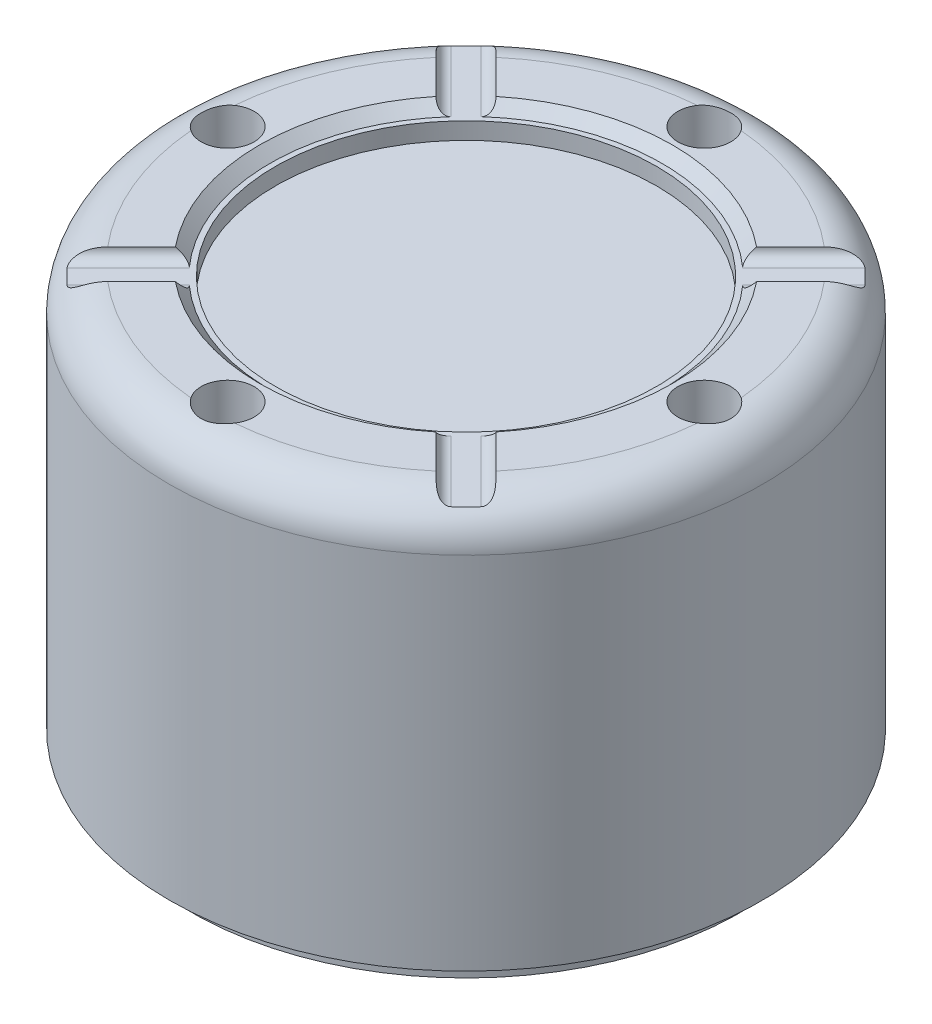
ISO-10303-21;
HEADER;
FILE_DESCRIPTION(('STEP AP214'),'2;1');
FILE_NAME('part.step','',(''),(''),'','','');
FILE_SCHEMA(('AUTOMOTIVE_DESIGN { 1 0 10303 214 1 1 1 1 }'));
ENDSEC;
DATA;
#1=APPLICATION_CONTEXT('core data for automotive mechanical design processes');
#2=APPLICATION_PROTOCOL_DEFINITION('international standard','automotive_design',2000,#1);
#3=PRODUCT_CONTEXT('',#1,'mechanical');
#4=PRODUCT('Part','Part','',(#3));
#5=PRODUCT_RELATED_PRODUCT_CATEGORY('part','',(#4));
#6=PRODUCT_DEFINITION_FORMATION('','',#4);
#7=PRODUCT_DEFINITION_CONTEXT('part definition',#1,'design');
#8=PRODUCT_DEFINITION('design','',#6,#7);
#9=PRODUCT_DEFINITION_SHAPE('','',#8);
#10=(LENGTH_UNIT() NAMED_UNIT(*) SI_UNIT(.MILLI.,.METRE.));
#11=(NAMED_UNIT(*) PLANE_ANGLE_UNIT() SI_UNIT($,.RADIAN.));
#12=(NAMED_UNIT(*) SI_UNIT($,.STERADIAN.) SOLID_ANGLE_UNIT());
#13=UNCERTAINTY_MEASURE_WITH_UNIT(LENGTH_MEASURE(1.E-05),#10,'distance_accuracy_value','');
#14=(GEOMETRIC_REPRESENTATION_CONTEXT(3) GLOBAL_UNCERTAINTY_ASSIGNED_CONTEXT((#13)) GLOBAL_UNIT_ASSIGNED_CONTEXT((#10,
#11,#12)) REPRESENTATION_CONTEXT('',''));
#15=CARTESIAN_POINT('',(0.,0.,0.));
#16=DIRECTION('',(0.,0.,1.));
#17=DIRECTION('',(1.,0.,0.));
#18=AXIS2_PLACEMENT_3D('',#15,#16,#17);
#19=CARTESIAN_POINT('',(0.,63.5,-30.95625));
#20=DIRECTION('',(0.,1.,0.));
#21=DIRECTION('',(0.,0.,1.));
#22=AXIS2_PLACEMENT_3D('',#19,#20,#21);
#23=PLANE('',#22);
#24=DIRECTION('',(-0.707106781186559,0.,0.707106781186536));
#25=VECTOR('',#24,1.);
#26=CARTESIAN_POINT('',(-37.9937988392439,63.5,33.5036707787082));
#27=LINE('',#26,#25);
#28=CARTESIAN_POINT('',(-24.0190024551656,63.5,19.5288743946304));
#29=VERTEX_POINT('',#28);
#30=CARTESIAN_POINT('',(-29.092125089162,63.5,24.6019970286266));
#31=VERTEX_POINT('',#30);
#32=EDGE_CURVE('E182',#29,#31,#27,.T.);
#33=ORIENTED_EDGE('',*,*,#32,.F.);
#34=CARTESIAN_POINT('',(0.,63.5,0.));
#35=DIRECTION('',(0.,-1.,0.));
#36=DIRECTION('',(0.,0.,-1.));
#37=AXIS2_PLACEMENT_3D('',#34,#35,#36);
#38=CIRCLE('',#37,30.95625);
#39=CARTESIAN_POINT('',(-24.0190024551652,63.5,-19.5288743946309));
#40=VERTEX_POINT('',#39);
#41=EDGE_CURVE('E392',#29,#40,#38,.T.);
#42=ORIENTED_EDGE('',*,*,#41,.T.);
#43=DIRECTION('',(0.707106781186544,0.,0.707106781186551));
#44=VECTOR('',#43,1.);
#45=CARTESIAN_POINT('',(-37.9937988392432,63.5,-33.503670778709));
#46=LINE('',#45,#44);
#47=CARTESIAN_POINT('',(-29.0921250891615,63.5,-24.6019970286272));
#48=VERTEX_POINT('',#47);
#49=EDGE_CURVE('E486',#48,#40,#46,.T.);
#50=ORIENTED_EDGE('',*,*,#49,.F.);
#51=CARTESIAN_POINT('',(0.,63.5,0.));
#52=DIRECTION('',(0.,-1.,0.));
#53=DIRECTION('',(0.,0.,-1.));
#54=AXIS2_PLACEMENT_3D('',#51,#52,#53);
#55=CIRCLE('',#54,38.1);
#56=CARTESIAN_POINT('',(-37.9588888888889,63.5,-3.27608826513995));
#57=VERTEX_POINT('',#56);
#58=EDGE_CURVE('E757',#57,#48,#55,.T.);
#59=ORIENTED_EDGE('',*,*,#58,.F.);
#60=CARTESIAN_POINT('',(-35.71875,63.5,0.));
#61=DIRECTION('',(0.,1.,0.));
#62=DIRECTION('',(0.,0.,1.));
#63=AXIS2_PLACEMENT_3D('',#60,#61,#62);
#64=CIRCLE('',#63,3.96875);
#65=CARTESIAN_POINT('',(-37.9588888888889,63.5,3.27608826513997));
#66=VERTEX_POINT('',#65);
#67=EDGE_CURVE('E460',#66,#57,#64,.T.);
#68=ORIENTED_EDGE('',*,*,#67,.F.);
#69=EDGE_CURVE('E194',#31,#66,#55,.T.);
#70=ORIENTED_EDGE('',*,*,#69,.F.);
#71=EDGE_LOOP('',(#33,#42,#50,#59,#68,#70));
#72=FACE_BOUND('',#71,.T.);
#73=ADVANCED_FACE('F30',(#72),#23,.T.);
#74=CARTESIAN_POINT('',(0.,63.5,0.));
#75=DIRECTION('',(0.,1.,0.));
#76=DIRECTION('',(0.,0.,1.));
#77=AXIS2_PLACEMENT_3D('',#74,#75,#76);
#78=CONICAL_SURFACE('',#77,30.95625,0.785398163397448);
#79=ORIENTED_EDGE('',*,*,#41,.F.);
#80=CARTESIAN_POINT('',(-24.0190024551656,63.5,19.5288743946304));
#81=CARTESIAN_POINT('',(-23.977033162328,63.4409763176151,19.4869280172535));
#82=CARTESIAN_POINT('',(-23.9328670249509,63.3817686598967,19.4473965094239));
#83=CARTESIAN_POINT('',(-23.840196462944,63.2632825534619,19.3735580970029));
#84=CARTESIAN_POINT('',(-23.7916843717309,63.2040041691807,19.3392607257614));
#85=CARTESIAN_POINT('',(-23.6900001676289,63.0852712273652,19.276111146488));
#86=CARTESIAN_POINT('',(-23.6367846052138,63.0258213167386,19.2473196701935));
#87=CARTESIAN_POINT('',(-23.5263236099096,62.9079579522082,19.1962873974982));
#88=CARTESIAN_POINT('',(-23.4690815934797,62.8495436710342,19.1740411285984));
#89=CARTESIAN_POINT('',(-23.3307546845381,62.7149543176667,19.1305628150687));
#90=CARTESIAN_POINT('',(-23.2481213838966,62.6394069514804,19.1121835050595));
#91=CARTESIAN_POINT('',(-23.0767587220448,62.493588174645,19.0907871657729));
#92=CARTESIAN_POINT('',(-22.9880522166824,62.4232988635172,19.0877154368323));
#93=CARTESIAN_POINT('',(-22.8268506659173,62.3062352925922,19.0982392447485));
#94=CARTESIAN_POINT('',(-22.7553472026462,62.2577808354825,19.1081467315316));
#95=CARTESIAN_POINT('',(-22.6106639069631,62.1677014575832,19.1400058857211));
#96=CARTESIAN_POINT('',(-22.5374857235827,62.1260701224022,19.1619461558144));
#97=CARTESIAN_POINT('',(-22.4048120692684,62.0588134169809,19.2137072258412));
#98=CARTESIAN_POINT('',(-22.3452548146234,62.0316536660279,19.2413614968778));
#99=CARTESIAN_POINT('',(-22.2280121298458,61.9849561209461,19.305543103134));
#100=CARTESIAN_POINT('',(-22.1703237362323,61.9654056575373,19.3420555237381));
#101=CARTESIAN_POINT('',(-22.0687981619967,61.9378417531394,19.4160712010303));
#102=CARTESIAN_POINT('',(-22.0243475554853,61.9283782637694,19.4521914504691));
#103=CARTESIAN_POINT('',(-21.9602740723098,61.9188705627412,19.5101229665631));
#104=CARTESIAN_POINT('',(-21.9393085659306,61.9164825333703,19.5301047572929));
#105=CARTESIAN_POINT('',(-21.898380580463,61.9132959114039,19.5712032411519));
#106=CARTESIAN_POINT('',(-21.8784184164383,61.9124978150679,19.592320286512));
#107=CARTESIAN_POINT('',(-21.8590133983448,61.9125,19.6139493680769));
#108=B_SPLINE_CURVE_WITH_KNOTS('',3,(#80,#81,#82,#83,#84,#85,#86,#87,#88,#89,#90,#91,#92,#93,
#94,#95,#96,#97,#98,#99,#100,#101,#102,#103,#104,#105,#106,#107),.UNSPECIFIED.,.F.,.F.,(4,2,2,2,
2,2,2,2,2,2,2,2,2,4),(0.,0.251049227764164,0.502550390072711,0.756683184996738,1.01060288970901,
1.34984662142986,1.68787723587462,1.94778238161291,2.20744177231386,2.4197528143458,
2.63170883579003,2.80518934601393,2.89229751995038,2.97943287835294),.UNSPECIFIED.);
#109=CARTESIAN_POINT('',(-21.8590133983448,61.9125,19.6139493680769));
#110=VERTEX_POINT('',#109);
#111=EDGE_CURVE('E11',#29,#110,#108,.T.);
#112=ORIENTED_EDGE('',*,*,#111,.T.);
#113=CARTESIAN_POINT('',(0.,61.9125,0.));
#114=DIRECTION('',(0.,-1.,0.));
#115=DIRECTION('',(0.,0.,-1.));
#116=AXIS2_PLACEMENT_3D('',#113,#114,#115);
#117=CIRCLE('',#116,29.36875);
#118=CARTESIAN_POINT('',(-21.8590133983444,61.9125,-19.6139493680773));
#119=VERTEX_POINT('',#118);
#120=EDGE_CURVE('E58',#110,#119,#117,.T.);
#121=ORIENTED_EDGE('',*,*,#120,.T.);
#122=CARTESIAN_POINT('',(-21.8590133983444,61.9125,-19.6139493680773));
#123=CARTESIAN_POINT('',(-21.8823881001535,61.912491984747,-19.5878882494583));
#124=CARTESIAN_POINT('',(-21.9065847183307,61.9136543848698,-19.5625677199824));
#125=CARTESIAN_POINT('',(-21.9563979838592,61.9182836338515,-19.5136110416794));
#126=CARTESIAN_POINT('',(-21.9820140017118,61.9217494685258,-19.4899741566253));
#127=CARTESIAN_POINT('',(-22.034284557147,61.9309179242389,-19.4447193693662));
#128=CARTESIAN_POINT('',(-22.0609308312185,61.9366051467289,-19.4230888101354));
#129=CARTESIAN_POINT('',(-22.1151849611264,61.9501226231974,-19.381807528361));
#130=CARTESIAN_POINT('',(-22.1427928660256,61.9579529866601,-19.3621569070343));
#131=CARTESIAN_POINT('',(-22.2266336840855,61.9844655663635,-19.3063891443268));
#132=CARTESIAN_POINT('',(-22.284005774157,62.0061912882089,-19.2733511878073));
#133=CARTESIAN_POINT('',(-22.4000058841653,62.0565316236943,-19.2158163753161));
#134=CARTESIAN_POINT('',(-22.4586358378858,62.0851576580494,-19.1913338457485));
#135=CARTESIAN_POINT('',(-22.5946593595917,62.1581007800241,-19.1440890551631));
#136=CARTESIAN_POINT('',(-22.6720120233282,62.204501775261,-19.1244226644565));
#137=CARTESIAN_POINT('',(-22.8243639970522,62.3042630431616,-19.0981685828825));
#138=CARTESIAN_POINT('',(-22.899359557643,62.3576337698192,-19.0916007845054));
#139=CARTESIAN_POINT('',(-23.0723533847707,62.4894156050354,-19.0896206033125));
#140=CARTESIAN_POINT('',(-23.1688256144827,62.569886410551,-19.0991199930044));
#141=CARTESIAN_POINT('',(-23.3538103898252,62.7360815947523,-19.1357885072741));
#142=CARTESIAN_POINT('',(-23.4422967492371,62.821821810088,-19.1630135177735));
#143=CARTESIAN_POINT('',(-23.5732961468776,62.9574752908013,-19.2170389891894));
#144=CARTESIAN_POINT('',(-23.6188965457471,63.0065407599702,-19.2387481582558));
#145=CARTESIAN_POINT('',(-23.7072554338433,63.1051830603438,-19.286454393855));
#146=CARTESIAN_POINT('',(-23.7500131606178,63.154760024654,-19.3124526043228));
#147=CARTESIAN_POINT('',(-23.8322064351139,63.253664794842,-19.3681394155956));
#148=CARTESIAN_POINT('',(-23.8716689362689,63.3029906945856,-19.3977918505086));
#149=CARTESIAN_POINT('',(-23.9475951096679,63.4015852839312,-19.4606954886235));
#150=CARTESIAN_POINT('',(-23.9840609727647,63.4508539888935,-19.4939440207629));
#151=CARTESIAN_POINT('',(-24.0190024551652,63.5,-19.5288743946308));
#152=B_SPLINE_CURVE_WITH_KNOTS('',3,(#122,#123,#124,#125,#126,#127,#128,#129,#130,#131,#132,
#133,#134,#135,#136,#137,#138,#139,#140,#141,#142,#143,#144,#145,#146,#147,#148,#149,#150,#151),
.UNSPECIFIED.,.F.,.F.,(4,2,2,2,2,2,2,2,2,2,2,2,2,2,4),(0.,0.104983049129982,0.20991990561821,
0.314141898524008,0.41836921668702,0.626343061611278,0.834663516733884,1.11010480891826,
1.38596408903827,1.76190700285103,2.13904097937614,2.35011855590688,2.56125252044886,
2.77044335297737,2.9794798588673),.UNSPECIFIED.);
#153=EDGE_CURVE('E343',#119,#40,#152,.T.);
#154=ORIENTED_EDGE('',*,*,#153,.T.);
#155=EDGE_LOOP('',(#79,#112,#121,#154));
#156=FACE_BOUND('',#155,.T.);
#157=ADVANCED_FACE('F331',(#156),#78,.F.);
#158=DIRECTION('',(0.707106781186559,0.,-0.707106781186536));
#159=VECTOR('',#158,1.);
#160=CARTESIAN_POINT('',(-33.5036707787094,63.5,37.9937988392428));
#161=LINE('',#160,#159);
#162=CARTESIAN_POINT('',(-24.6019970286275,63.5,29.0921250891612));
#163=VERTEX_POINT('',#162);
#164=CARTESIAN_POINT('',(-19.5288743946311,63.5,24.019002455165));
#165=VERTEX_POINT('',#164);
#166=EDGE_CURVE('E173',#163,#165,#161,.T.);
#167=ORIENTED_EDGE('',*,*,#166,.F.);
#168=CARTESIAN_POINT('',(-3.27608826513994,63.5,37.9588888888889));
#169=VERTEX_POINT('',#168);
#170=EDGE_CURVE('E177',#169,#163,#55,.T.);
#171=ORIENTED_EDGE('',*,*,#170,.F.);
#172=CARTESIAN_POINT('',(0.,63.5,35.71875));
#173=DIRECTION('',(0.,1.,0.));
#174=DIRECTION('',(0.,0.,1.));
#175=AXIS2_PLACEMENT_3D('',#172,#173,#174);
#176=CIRCLE('',#175,3.96875);
#177=CARTESIAN_POINT('',(3.27608826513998,63.5,37.9588888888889));
#178=VERTEX_POINT('',#177);
#179=EDGE_CURVE('E470',#178,#169,#176,.T.);
#180=ORIENTED_EDGE('',*,*,#179,.F.);
#181=CARTESIAN_POINT('',(24.6019970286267,63.5,29.0921250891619));
#182=VERTEX_POINT('',#181);
#183=EDGE_CURVE('E391',#182,#178,#55,.T.);
#184=ORIENTED_EDGE('',*,*,#183,.F.);
#185=DIRECTION('',(0.707106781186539,0.,0.707106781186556));
#186=VECTOR('',#185,1.);
#187=CARTESIAN_POINT('',(33.5036707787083,63.5,37.9937988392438));
#188=LINE('',#187,#186);
#189=CARTESIAN_POINT('',(19.5288743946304,63.5,24.0190024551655));
#190=VERTEX_POINT('',#189);
#191=EDGE_CURVE('E764',#190,#182,#188,.T.);
#192=ORIENTED_EDGE('',*,*,#191,.F.);
#193=EDGE_CURVE('E179',#190,#165,#38,.T.);
#194=ORIENTED_EDGE('',*,*,#193,.T.);
#195=EDGE_LOOP('',(#167,#171,#180,#184,#192,#194));
#196=FACE_BOUND('',#195,.T.);
#197=ADVANCED_FACE('F175',(#196),#23,.T.);
#198=CARTESIAN_POINT('',(19.6139493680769,61.9125,21.8590133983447));
#199=VERTEX_POINT('',#198);
#200=CARTESIAN_POINT('',(-19.6139493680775,61.9125,21.8590133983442));
#201=VERTEX_POINT('',#200);
#202=EDGE_CURVE('E50',#199,#201,#117,.T.);
#203=ORIENTED_EDGE('',*,*,#202,.T.);
#204=CARTESIAN_POINT('',(-19.6139493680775,61.9125,21.8590133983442));
#205=CARTESIAN_POINT('',(-19.5878882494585,61.912491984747,21.8823881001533));
#206=CARTESIAN_POINT('',(-19.5625677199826,61.9136543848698,21.9065847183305));
#207=CARTESIAN_POINT('',(-19.5136110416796,61.9182836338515,21.956397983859));
#208=CARTESIAN_POINT('',(-19.4899741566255,61.9217494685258,21.9820140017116));
#209=CARTESIAN_POINT('',(-19.4447193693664,61.9309179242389,22.0342845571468));
#210=CARTESIAN_POINT('',(-19.4230888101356,61.9366051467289,22.0609308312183));
#211=CARTESIAN_POINT('',(-19.3818075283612,61.9501226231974,22.1151849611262));
#212=CARTESIAN_POINT('',(-19.3621569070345,61.9579529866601,22.1427928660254));
#213=CARTESIAN_POINT('',(-19.306389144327,61.9844655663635,22.2266336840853));
#214=CARTESIAN_POINT('',(-19.2733511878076,62.0061912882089,22.2840057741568));
#215=CARTESIAN_POINT('',(-19.2158163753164,62.0565316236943,22.4000058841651));
#216=CARTESIAN_POINT('',(-19.1913338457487,62.0851576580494,22.4586358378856));
#217=CARTESIAN_POINT('',(-19.1440890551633,62.1581007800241,22.5946593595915));
#218=CARTESIAN_POINT('',(-19.1244226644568,62.204501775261,22.672012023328));
#219=CARTESIAN_POINT('',(-19.0981685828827,62.3042630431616,22.824363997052));
#220=CARTESIAN_POINT('',(-19.0916007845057,62.3576337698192,22.8993595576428));
#221=CARTESIAN_POINT('',(-19.0896206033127,62.4894156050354,23.0723533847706));
#222=CARTESIAN_POINT('',(-19.0991199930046,62.5698864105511,23.1688256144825));
#223=CARTESIAN_POINT('',(-19.1357885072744,62.7360815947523,23.353810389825));
#224=CARTESIAN_POINT('',(-19.1630135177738,62.8218218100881,23.442296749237));
#225=CARTESIAN_POINT('',(-19.2170389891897,62.9574752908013,23.5732961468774));
#226=CARTESIAN_POINT('',(-19.238748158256,63.0065407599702,23.6188965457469));
#227=CARTESIAN_POINT('',(-19.2864543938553,63.1051830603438,23.7072554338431));
#228=CARTESIAN_POINT('',(-19.312452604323,63.1547600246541,23.7500131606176));
#229=CARTESIAN_POINT('',(-19.3681394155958,63.253664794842,23.8322064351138));
#230=CARTESIAN_POINT('',(-19.3977918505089,63.3029906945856,23.8716689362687));
#231=CARTESIAN_POINT('',(-19.4606954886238,63.4015852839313,23.9475951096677));
#232=CARTESIAN_POINT('',(-19.4939440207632,63.4508539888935,23.9840609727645));
#233=CARTESIAN_POINT('',(-19.5288743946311,63.5,24.019002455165));
#234=B_SPLINE_CURVE_WITH_KNOTS('',3,(#204,#205,#206,#207,#208,#209,#210,#211,#212,#213,#214,
#215,#216,#217,#218,#219,#220,#221,#222,#223,#224,#225,#226,#227,#228,#229,#230,#231,#232,#233),
.UNSPECIFIED.,.F.,.F.,(4,2,2,2,2,2,2,2,2,2,2,2,2,2,4),(0.,0.104983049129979,0.20991990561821,
0.314141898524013,0.418369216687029,0.626343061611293,0.834663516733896,1.11010480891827,
1.38596408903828,1.76190700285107,2.13904097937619,2.35011855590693,2.5612525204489,
2.7704433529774,2.97947985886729),.UNSPECIFIED.);
#235=EDGE_CURVE('E201',#201,#165,#234,.T.);
#236=ORIENTED_EDGE('',*,*,#235,.T.);
#237=ORIENTED_EDGE('',*,*,#193,.F.);
#238=CARTESIAN_POINT('',(19.5288743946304,63.5,24.0190024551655));
#239=CARTESIAN_POINT('',(19.4869280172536,63.4409763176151,23.977033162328));
#240=CARTESIAN_POINT('',(19.447396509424,63.3817686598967,23.9328670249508));
#241=CARTESIAN_POINT('',(19.373558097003,63.2632825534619,23.840196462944));
#242=CARTESIAN_POINT('',(19.3392607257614,63.2040041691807,23.7916843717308));
#243=CARTESIAN_POINT('',(19.276111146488,63.0852712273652,23.6900001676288));
#244=CARTESIAN_POINT('',(19.2473196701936,63.0258213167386,23.6367846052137));
#245=CARTESIAN_POINT('',(19.1962873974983,62.9079579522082,23.5263236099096));
#246=CARTESIAN_POINT('',(19.1740411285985,62.8495436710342,23.4690815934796));
#247=CARTESIAN_POINT('',(19.1305628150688,62.7149543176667,23.3307546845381));
#248=CARTESIAN_POINT('',(19.1121835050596,62.6394069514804,23.2481213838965));
#249=CARTESIAN_POINT('',(19.090787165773,62.493588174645,23.0767587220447));
#250=CARTESIAN_POINT('',(19.0877154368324,62.4232988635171,22.9880522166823));
#251=CARTESIAN_POINT('',(19.0982392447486,62.3062352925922,22.8268506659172));
#252=CARTESIAN_POINT('',(19.1081467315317,62.2577808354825,22.7553472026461));
#253=CARTESIAN_POINT('',(19.1400058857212,62.1677014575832,22.610663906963));
#254=CARTESIAN_POINT('',(19.1619461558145,62.1260701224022,22.5374857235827));
#255=CARTESIAN_POINT('',(19.2137072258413,62.0588134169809,22.4048120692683));
#256=CARTESIAN_POINT('',(19.2413614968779,62.0316536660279,22.3452548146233));
#257=CARTESIAN_POINT('',(19.3055431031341,61.9849561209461,22.2280121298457));
#258=CARTESIAN_POINT('',(19.3420555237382,61.9654056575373,22.1703237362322));
#259=CARTESIAN_POINT('',(19.4160712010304,61.9378417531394,22.0687981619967));
#260=CARTESIAN_POINT('',(19.4521914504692,61.9283782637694,22.0243475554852));
#261=CARTESIAN_POINT('',(19.5101229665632,61.9188705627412,21.9602740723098));
#262=CARTESIAN_POINT('',(19.530104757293,61.9164825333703,21.9393085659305));
#263=CARTESIAN_POINT('',(19.571203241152,61.9132959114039,21.8983805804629));
#264=CARTESIAN_POINT('',(19.5923202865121,61.9124978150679,21.8784184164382));
#265=CARTESIAN_POINT('',(19.6139493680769,61.9125,21.8590133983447));
#266=B_SPLINE_CURVE_WITH_KNOTS('',3,(#238,#239,#240,#241,#242,#243,#244,#245,#246,#247,#248,
#249,#250,#251,#252,#253,#254,#255,#256,#257,#258,#259,#260,#261,#262,#263,#264,#265),
.UNSPECIFIED.,.F.,.F.,(4,2,2,2,2,2,2,2,2,2,2,2,2,4),(0.,0.251049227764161,0.502550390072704,
0.756683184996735,1.010602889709,1.34984662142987,1.68787723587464,1.94778238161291,
2.20744177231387,2.4197528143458,2.63170883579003,2.80518934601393,2.89229751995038,
2.97943287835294),.UNSPECIFIED.);
#267=EDGE_CURVE('E301',#190,#199,#266,.T.);
#268=ORIENTED_EDGE('',*,*,#267,.T.);
#269=EDGE_LOOP('',(#203,#236,#237,#268));
#270=FACE_BOUND('',#269,.T.);
#271=ADVANCED_FACE('F531',(#270),#78,.F.);
#272=DIRECTION('',(-0.707106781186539,0.,-0.707106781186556));
#273=VECTOR('',#272,1.);
#274=CARTESIAN_POINT('',(37.9937988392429,63.5,33.5036707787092));
#275=LINE('',#274,#273);
#276=CARTESIAN_POINT('',(29.0921250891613,63.5,24.6019970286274));
#277=VERTEX_POINT('',#276);
#278=CARTESIAN_POINT('',(24.0190024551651,63.5,19.528874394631));
#279=VERTEX_POINT('',#278);
#280=EDGE_CURVE('E375',#277,#279,#275,.T.);
#281=ORIENTED_EDGE('',*,*,#280,.F.);
#282=CARTESIAN_POINT('',(37.9588888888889,63.5,3.27608826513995));
#283=VERTEX_POINT('',#282);
#284=EDGE_CURVE('E196',#283,#277,#55,.T.);
#285=ORIENTED_EDGE('',*,*,#284,.F.);
#286=CARTESIAN_POINT('',(35.71875,63.5,0.));
#287=DIRECTION('',(0.,1.,0.));
#288=DIRECTION('',(0.,0.,1.));
#289=AXIS2_PLACEMENT_3D('',#286,#287,#288);
#290=CIRCLE('',#289,3.96875);
#291=CARTESIAN_POINT('',(37.9588888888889,63.5,-3.27608826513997));
#292=VERTEX_POINT('',#291);
#293=EDGE_CURVE('E465',#292,#283,#290,.T.);
#294=ORIENTED_EDGE('',*,*,#293,.F.);
#295=CARTESIAN_POINT('',(29.0921250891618,63.5,-24.6019970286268));
#296=VERTEX_POINT('',#295);
#297=EDGE_CURVE('E760',#296,#292,#55,.T.);
#298=ORIENTED_EDGE('',*,*,#297,.F.);
#299=DIRECTION('',(0.707106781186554,0.,-0.707106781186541));
#300=VECTOR('',#299,1.);
#301=CARTESIAN_POINT('',(37.9937988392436,63.5,-33.5036707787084));
#302=LINE('',#301,#300);
#303=CARTESIAN_POINT('',(24.0190024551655,63.5,-19.5288743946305));
#304=VERTEX_POINT('',#303);
#305=EDGE_CURVE('E387',#304,#296,#302,.T.);
#306=ORIENTED_EDGE('',*,*,#305,.F.);
#307=EDGE_CURVE('E379',#304,#279,#38,.T.);
#308=ORIENTED_EDGE('',*,*,#307,.T.);
#309=EDGE_LOOP('',(#281,#285,#294,#298,#306,#308));
#310=FACE_BOUND('',#309,.T.);
#311=ADVANCED_FACE('F382',(#310),#23,.T.);
#312=CARTESIAN_POINT('',(21.8590133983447,61.9125,-19.613949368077));
#313=VERTEX_POINT('',#312);
#314=CARTESIAN_POINT('',(21.8590133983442,61.9125,19.6139493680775));
#315=VERTEX_POINT('',#314);
#316=EDGE_CURVE('E370',#313,#315,#117,.T.);
#317=ORIENTED_EDGE('',*,*,#316,.T.);
#318=CARTESIAN_POINT('',(21.8590133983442,61.9125,19.6139493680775));
#319=CARTESIAN_POINT('',(21.8823881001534,61.912491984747,19.5878882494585));
#320=CARTESIAN_POINT('',(21.9065847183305,61.9136543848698,19.5625677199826));
#321=CARTESIAN_POINT('',(21.956397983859,61.9182836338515,19.5136110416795));
#322=CARTESIAN_POINT('',(21.9820140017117,61.9217494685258,19.4899741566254));
#323=CARTESIAN_POINT('',(22.0342845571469,61.9309179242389,19.4447193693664));
#324=CARTESIAN_POINT('',(22.0609308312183,61.9366051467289,19.4230888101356));
#325=CARTESIAN_POINT('',(22.1151849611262,61.9501226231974,19.3818075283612));
#326=CARTESIAN_POINT('',(22.1427928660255,61.9579529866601,19.3621569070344));
#327=CARTESIAN_POINT('',(22.2266336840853,61.9844655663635,19.306389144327));
#328=CARTESIAN_POINT('',(22.2840057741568,62.0061912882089,19.2733511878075));
#329=CARTESIAN_POINT('',(22.4000058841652,62.0565316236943,19.2158163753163));
#330=CARTESIAN_POINT('',(22.4586358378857,62.0851576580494,19.1913338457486));
#331=CARTESIAN_POINT('',(22.5946593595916,62.1581007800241,19.1440890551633));
#332=CARTESIAN_POINT('',(22.6720120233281,62.204501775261,19.1244226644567));
#333=CARTESIAN_POINT('',(22.8243639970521,62.3042630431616,19.0981685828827));
#334=CARTESIAN_POINT('',(22.8993595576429,62.3576337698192,19.0916007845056));
#335=CARTESIAN_POINT('',(23.0723533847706,62.4894156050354,19.0896206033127));
#336=CARTESIAN_POINT('',(23.1688256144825,62.5698864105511,19.0991199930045));
#337=CARTESIAN_POINT('',(23.3538103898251,62.7360815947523,19.1357885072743));
#338=CARTESIAN_POINT('',(23.442296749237,62.8218218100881,19.1630135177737));
#339=CARTESIAN_POINT('',(23.5732961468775,62.9574752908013,19.2170389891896));
#340=CARTESIAN_POINT('',(23.618896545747,63.0065407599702,19.238748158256));
#341=CARTESIAN_POINT('',(23.7072554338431,63.1051830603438,19.2864543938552));
#342=CARTESIAN_POINT('',(23.7500131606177,63.1547600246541,19.3124526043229));
#343=CARTESIAN_POINT('',(23.8322064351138,63.253664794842,19.3681394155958));
#344=CARTESIAN_POINT('',(23.8716689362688,63.3029906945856,19.3977918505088));
#345=CARTESIAN_POINT('',(23.9475951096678,63.4015852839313,19.4606954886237));
#346=CARTESIAN_POINT('',(23.9840609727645,63.4508539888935,19.4939440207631));
#347=CARTESIAN_POINT('',(24.0190024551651,63.5,19.528874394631));
#348=B_SPLINE_CURVE_WITH_KNOTS('',3,(#318,#319,#320,#321,#322,#323,#324,#325,#326,#327,#328,
#329,#330,#331,#332,#333,#334,#335,#336,#337,#338,#339,#340,#341,#342,#343,#344,#345,#346,#347),
.UNSPECIFIED.,.F.,.F.,(4,2,2,2,2,2,2,2,2,2,2,2,2,2,4),(0.,0.104983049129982,0.20991990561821,
0.314141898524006,0.418369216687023,0.62634306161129,0.83466351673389,1.11010480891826,
1.38596408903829,1.76190700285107,2.13904097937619,2.35011855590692,2.5612525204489,
2.77044335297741,2.9794798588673),.UNSPECIFIED.);
#349=EDGE_CURVE('E318',#315,#279,#348,.T.);
#350=ORIENTED_EDGE('',*,*,#349,.T.);
#351=ORIENTED_EDGE('',*,*,#307,.F.);
#352=CARTESIAN_POINT('',(24.0190024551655,63.5,-19.5288743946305));
#353=CARTESIAN_POINT('',(23.9770331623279,63.4409763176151,-19.4869280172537));
#354=CARTESIAN_POINT('',(23.9328670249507,63.3817686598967,-19.4473965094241));
#355=CARTESIAN_POINT('',(23.8401964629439,63.2632825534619,-19.3735580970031));
#356=CARTESIAN_POINT('',(23.7916843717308,63.2040041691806,-19.3392607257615));
#357=CARTESIAN_POINT('',(23.6900001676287,63.0852712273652,-19.2761111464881));
#358=CARTESIAN_POINT('',(23.6367846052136,63.0258213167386,-19.2473196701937));
#359=CARTESIAN_POINT('',(23.5263236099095,62.9079579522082,-19.1962873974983));
#360=CARTESIAN_POINT('',(23.4690815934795,62.8495436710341,-19.1740411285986));
#361=CARTESIAN_POINT('',(23.330754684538,62.7149543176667,-19.1305628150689));
#362=CARTESIAN_POINT('',(23.2481213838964,62.6394069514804,-19.1121835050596));
#363=CARTESIAN_POINT('',(23.0767587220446,62.493588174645,-19.0907871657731));
#364=CARTESIAN_POINT('',(22.9880522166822,62.4232988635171,-19.0877154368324));
#365=CARTESIAN_POINT('',(22.8268506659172,62.3062352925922,-19.0982392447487));
#366=CARTESIAN_POINT('',(22.755347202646,62.2577808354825,-19.1081467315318));
#367=CARTESIAN_POINT('',(22.6106639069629,62.1677014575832,-19.1400058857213));
#368=CARTESIAN_POINT('',(22.5374857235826,62.1260701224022,-19.1619461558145));
#369=CARTESIAN_POINT('',(22.4048120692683,62.0588134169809,-19.2137072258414));
#370=CARTESIAN_POINT('',(22.3452548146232,62.0316536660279,-19.241361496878));
#371=CARTESIAN_POINT('',(22.2280121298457,61.9849561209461,-19.3055431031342));
#372=CARTESIAN_POINT('',(22.1703237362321,61.9654056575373,-19.3420555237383));
#373=CARTESIAN_POINT('',(22.0687981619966,61.9378417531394,-19.4160712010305));
#374=CARTESIAN_POINT('',(22.0243475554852,61.9283782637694,-19.4521914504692));
#375=CARTESIAN_POINT('',(21.9602740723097,61.9188705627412,-19.5101229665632));
#376=CARTESIAN_POINT('',(21.9393085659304,61.9164825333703,-19.5301047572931));
#377=CARTESIAN_POINT('',(21.8983805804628,61.9132959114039,-19.5712032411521));
#378=CARTESIAN_POINT('',(21.8784184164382,61.9124978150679,-19.5923202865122));
#379=CARTESIAN_POINT('',(21.8590133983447,61.9125,-19.613949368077));
#380=B_SPLINE_CURVE_WITH_KNOTS('',3,(#352,#353,#354,#355,#356,#357,#358,#359,#360,#361,#362,
#363,#364,#365,#366,#367,#368,#369,#370,#371,#372,#373,#374,#375,#376,#377,#378,#379),
.UNSPECIFIED.,.F.,.F.,(4,2,2,2,2,2,2,2,2,2,2,2,2,4),(0.,0.251049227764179,0.502550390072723,
0.756683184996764,1.01060288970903,1.34984662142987,1.68787723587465,1.94778238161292,
2.20744177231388,2.41975281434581,2.63170883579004,2.80518934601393,2.89229751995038,
2.97943287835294),.UNSPECIFIED.);
#381=EDGE_CURVE('E355',#304,#313,#380,.T.);
#382=ORIENTED_EDGE('',*,*,#381,.T.);
#383=EDGE_LOOP('',(#317,#350,#351,#382));
#384=FACE_BOUND('',#383,.T.);
#385=ADVANCED_FACE('F332',(#384),#78,.F.);
#386=CARTESIAN_POINT('',(-35.71875,63.5,0.));
#387=DIRECTION('',(0.,1.,0.));
#388=DIRECTION('',(0.,0.,1.));
#389=AXIS2_PLACEMENT_3D('',#386,#387,#388);
#390=CYLINDRICAL_SURFACE('',#389,2.24789999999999);
#391=CARTESIAN_POINT('',(-35.71875,0.,0.));
#392=DIRECTION('',(0.,1.,0.));
#393=DIRECTION('',(0.,0.,1.));
#394=AXIS2_PLACEMENT_3D('',#391,#392,#393);
#395=CIRCLE('',#394,2.24789999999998);
#396=CARTESIAN_POINT('',(-35.71875,0.,2.24789999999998));
#397=VERTEX_POINT('',#396);
#398=EDGE_CURVE('E457',#397,#397,#395,.T.);
#399=ORIENTED_EDGE('',*,*,#398,.F.);
#400=EDGE_LOOP('',(#399));
#401=FACE_BOUND('',#400,.T.);
#402=CARTESIAN_POINT('',(-35.71875,50.8,0.));
#403=DIRECTION('',(0.,1.,0.));
#404=DIRECTION('',(0.,0.,1.));
#405=AXIS2_PLACEMENT_3D('',#402,#403,#404);
#406=CIRCLE('',#405,2.24789999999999);
#407=CARTESIAN_POINT('',(-35.71875,50.8,2.24789999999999));
#408=VERTEX_POINT('',#407);
#409=EDGE_CURVE('E429',#408,#408,#406,.F.);
#410=ORIENTED_EDGE('',*,*,#409,.F.);
#411=EDGE_LOOP('',(#410));
#412=FACE_BOUND('',#411,.T.);
#413=ADVANCED_FACE('F542',(#401,#412),#390,.F.);
#414=CARTESIAN_POINT('',(0.,63.5,35.71875));
#415=DIRECTION('',(0.,1.,0.));
#416=DIRECTION('',(0.,0.,1.));
#417=AXIS2_PLACEMENT_3D('',#414,#415,#416);
#418=CYLINDRICAL_SURFACE('',#417,2.24789999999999);
#419=CARTESIAN_POINT('',(0.,0.,35.71875));
#420=DIRECTION('',(0.,1.,0.));
#421=DIRECTION('',(0.,0.,1.));
#422=AXIS2_PLACEMENT_3D('',#419,#420,#421);
#423=CIRCLE('',#422,2.24789999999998);
#424=CARTESIAN_POINT('',(0.,0.,37.96665));
#425=VERTEX_POINT('',#424);
#426=EDGE_CURVE('E467',#425,#425,#423,.T.);
#427=ORIENTED_EDGE('',*,*,#426,.F.);
#428=EDGE_LOOP('',(#427));
#429=FACE_BOUND('',#428,.T.);
#430=CARTESIAN_POINT('',(0.,50.8,35.71875));
#431=DIRECTION('',(0.,1.,0.));
#432=DIRECTION('',(0.,0.,1.));
#433=AXIS2_PLACEMENT_3D('',#430,#431,#432);
#434=CIRCLE('',#433,2.24789999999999);
#435=CARTESIAN_POINT('',(0.,50.8,37.96665));
#436=VERTEX_POINT('',#435);
#437=EDGE_CURVE('E434',#436,#436,#434,.F.);
#438=ORIENTED_EDGE('',*,*,#437,.F.);
#439=EDGE_LOOP('',(#438));
#440=FACE_BOUND('',#439,.T.);
#441=ADVANCED_FACE('F667',(#429,#440),#418,.F.);
#442=CARTESIAN_POINT('',(35.71875,63.5,0.));
#443=DIRECTION('',(0.,1.,0.));
#444=DIRECTION('',(0.,0.,1.));
#445=AXIS2_PLACEMENT_3D('',#442,#443,#444);
#446=CYLINDRICAL_SURFACE('',#445,2.24789999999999);
#447=CARTESIAN_POINT('',(35.71875,0.,0.));
#448=DIRECTION('',(0.,1.,0.));
#449=DIRECTION('',(0.,0.,1.));
#450=AXIS2_PLACEMENT_3D('',#447,#448,#449);
#451=CIRCLE('',#450,2.24789999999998);
#452=CARTESIAN_POINT('',(35.71875,0.,2.24789999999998));
#453=VERTEX_POINT('',#452);
#454=EDGE_CURVE('E462',#453,#453,#451,.T.);
#455=ORIENTED_EDGE('',*,*,#454,.F.);
#456=EDGE_LOOP('',(#455));
#457=FACE_BOUND('',#456,.T.);
#458=CARTESIAN_POINT('',(35.71875,50.8,0.));
#459=DIRECTION('',(0.,1.,0.));
#460=DIRECTION('',(0.,0.,1.));
#461=AXIS2_PLACEMENT_3D('',#458,#459,#460);
#462=CIRCLE('',#461,2.24789999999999);
#463=CARTESIAN_POINT('',(35.71875,50.8,2.24789999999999));
#464=VERTEX_POINT('',#463);
#465=EDGE_CURVE('E438',#464,#464,#462,.F.);
#466=ORIENTED_EDGE('',*,*,#465,.F.);
#467=EDGE_LOOP('',(#466));
#468=FACE_BOUND('',#467,.T.);
#469=ADVANCED_FACE('F656',(#457,#468),#446,.F.);
#470=CARTESIAN_POINT('',(0.,63.5,-35.71875));
#471=DIRECTION('',(0.,1.,0.));
#472=DIRECTION('',(0.,0.,1.));
#473=AXIS2_PLACEMENT_3D('',#470,#471,#472);
#474=CYLINDRICAL_SURFACE('',#473,2.24789999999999);
#475=CARTESIAN_POINT('',(0.,0.,-35.71875));
#476=DIRECTION('',(0.,1.,0.));
#477=DIRECTION('',(0.,0.,1.));
#478=AXIS2_PLACEMENT_3D('',#475,#476,#477);
#479=CIRCLE('',#478,2.24789999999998);
#480=CARTESIAN_POINT('',(0.,0.,-33.47085));
#481=VERTEX_POINT('',#480);
#482=EDGE_CURVE('E443',#481,#481,#479,.T.);
#483=ORIENTED_EDGE('',*,*,#482,.F.);
#484=EDGE_LOOP('',(#483));
#485=FACE_BOUND('',#484,.T.);
#486=CARTESIAN_POINT('',(0.,50.8,-35.71875));
#487=DIRECTION('',(0.,1.,0.));
#488=DIRECTION('',(0.,0.,1.));
#489=AXIS2_PLACEMENT_3D('',#486,#487,#488);
#490=CIRCLE('',#489,2.24789999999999);
#491=CARTESIAN_POINT('',(0.,50.8,-33.47085));
#492=VERTEX_POINT('',#491);
#493=EDGE_CURVE('E441',#492,#492,#490,.F.);
#494=ORIENTED_EDGE('',*,*,#493,.F.);
#495=EDGE_LOOP('',(#494));
#496=FACE_BOUND('',#495,.T.);
#497=ADVANCED_FACE('F650',(#485,#496),#474,.F.);
#498=CARTESIAN_POINT('',(0.,0.,-41.2115));
#499=DIRECTION('',(0.,-1.,0.));
#500=DIRECTION('',(0.,0.,-1.));
#501=AXIS2_PLACEMENT_3D('',#498,#499,#500);
#502=PLANE('',#501);
#503=ORIENTED_EDGE('',*,*,#482,.T.);
#504=EDGE_LOOP('',(#503));
#505=FACE_BOUND('',#504,.T.);
#506=ORIENTED_EDGE('',*,*,#398,.T.);
#507=EDGE_LOOP('',(#506));
#508=FACE_BOUND('',#507,.T.);
#509=ORIENTED_EDGE('',*,*,#454,.T.);
#510=EDGE_LOOP('',(#509));
#511=FACE_BOUND('',#510,.T.);
#512=ORIENTED_EDGE('',*,*,#426,.T.);
#513=EDGE_LOOP('',(#512));
#514=FACE_BOUND('',#513,.T.);
#515=CARTESIAN_POINT('',(0.,0.,0.));
#516=DIRECTION('',(0.,-1.,0.));
#517=DIRECTION('',(0.,0.,-1.));
#518=AXIS2_PLACEMENT_3D('',#515,#516,#517);
#519=CIRCLE('',#518,41.2115);
#520=CARTESIAN_POINT('',(0.,0.,-41.2115));
#521=VERTEX_POINT('',#520);
#522=EDGE_CURVE('E404',#521,#521,#519,.T.);
#523=ORIENTED_EDGE('',*,*,#522,.T.);
#524=EDGE_LOOP('',(#523));
#525=FACE_BOUND('',#524,.T.);
#526=ADVANCED_FACE('F655',(#505,#508,#511,#514,#525),#502,.T.);
#527=CARTESIAN_POINT('',(0.,0.,0.));
#528=DIRECTION('',(0.,-1.,0.));
#529=DIRECTION('',(0.,0.,-1.));
#530=AXIS2_PLACEMENT_3D('',#527,#528,#529);
#531=CYLINDRICAL_SURFACE('',#530,41.2115);
#532=CARTESIAN_POINT('',(0.,3.175,0.));
#533=DIRECTION('',(0.,-1.,0.));
#534=DIRECTION('',(0.,0.,-1.));
#535=AXIS2_PLACEMENT_3D('',#532,#533,#534);
#536=CIRCLE('',#535,41.2115);
#537=CARTESIAN_POINT('',(0.,3.175,-41.2115));
#538=VERTEX_POINT('',#537);
#539=EDGE_CURVE('E402',#538,#538,#536,.T.);
#540=ORIENTED_EDGE('',*,*,#539,.T.);
#541=EDGE_LOOP('',(#540));
#542=FACE_BOUND('',#541,.T.);
#543=ORIENTED_EDGE('',*,*,#522,.F.);
#544=EDGE_LOOP('',(#543));
#545=FACE_BOUND('',#544,.T.);
#546=ADVANCED_FACE('F692',(#542,#545),#531,.T.);
#547=CARTESIAN_POINT('',(0.,3.175,-44.45));
#548=DIRECTION('',(0.,-1.,0.));
#549=DIRECTION('',(0.,0.,-1.));
#550=AXIS2_PLACEMENT_3D('',#547,#548,#549);
#551=PLANE('',#550);
#552=CARTESIAN_POINT('',(0.,3.175,0.));
#553=DIRECTION('',(0.,-1.,0.));
#554=DIRECTION('',(0.,0.,-1.));
#555=AXIS2_PLACEMENT_3D('',#552,#553,#554);
#556=CIRCLE('',#555,44.45);
#557=CARTESIAN_POINT('',(0.,3.175,-44.45));
#558=VERTEX_POINT('',#557);
#559=EDGE_CURVE('E399',#558,#558,#556,.T.);
#560=ORIENTED_EDGE('',*,*,#559,.T.);
#561=EDGE_LOOP('',(#560));
#562=FACE_BOUND('',#561,.T.);
#563=ORIENTED_EDGE('',*,*,#539,.F.);
#564=EDGE_LOOP('',(#563));
#565=FACE_BOUND('',#564,.T.);
#566=ADVANCED_FACE('F712',(#562,#565),#551,.T.);
#567=CARTESIAN_POINT('',(0.,0.,0.));
#568=DIRECTION('',(0.,-1.,0.));
#569=DIRECTION('',(0.,0.,-1.));
#570=AXIS2_PLACEMENT_3D('',#567,#568,#569);
#571=CYLINDRICAL_SURFACE('',#570,44.45);
#572=CARTESIAN_POINT('',(0.,57.15,0.));
#573=DIRECTION('',(0.,-1.,0.));
#574=DIRECTION('',(0.,0.,-1.));
#575=AXIS2_PLACEMENT_3D('',#572,#573,#574);
#576=CIRCLE('',#575,44.45);
#577=CARTESIAN_POINT('',(0.,57.15,-44.45));
#578=VERTEX_POINT('',#577);
#579=EDGE_CURVE('E193',#578,#578,#576,.T.);
#580=ORIENTED_EDGE('',*,*,#579,.T.);
#581=EDGE_LOOP('',(#580));
#582=FACE_BOUND('',#581,.T.);
#583=ORIENTED_EDGE('',*,*,#559,.F.);
#584=EDGE_LOOP('',(#583));
#585=FACE_BOUND('',#584,.T.);
#586=ADVANCED_FACE('F222',(#582,#585),#571,.T.);
#587=CARTESIAN_POINT('',(0.,57.15,0.));
#588=DIRECTION('',(0.,-1.,0.));
#589=DIRECTION('',(0.,0.,-1.));
#590=AXIS2_PLACEMENT_3D('',#587,#588,#589);
#591=TOROIDAL_SURFACE('',#590,38.1,6.35000000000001);
#592=CARTESIAN_POINT('',(0.,61.9125,0.));
#593=DIRECTION('',(0.,-1.,0.));
#594=DIRECTION('',(0.,0.,-1.));
#595=AXIS2_PLACEMENT_3D('',#592,#593,#594);
#596=CIRCLE('',#595,42.300130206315);
#597=CARTESIAN_POINT('',(-31.012169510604,61.9125,28.7671054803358));
#598=VERTEX_POINT('',#597);
#599=CARTESIAN_POINT('',(-28.7671054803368,61.9125,31.0121695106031));
#600=VERTEX_POINT('',#599);
#601=EDGE_CURVE('E768',#598,#600,#596,.F.);
#602=ORIENTED_EDGE('',*,*,#601,.F.);
#603=CARTESIAN_POINT('',(-31.012169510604,61.9125,28.7671054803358));
#604=CARTESIAN_POINT('',(-31.035062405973,61.9124912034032,28.7424358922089));
#605=CARTESIAN_POINT('',(-31.0570217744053,61.9135684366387,28.7169122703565));
#606=CARTESIAN_POINT('',(-31.0989064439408,61.9178086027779,28.6644461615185));
#607=CARTESIAN_POINT('',(-31.118833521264,61.9209696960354,28.637504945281));
#608=CARTESIAN_POINT('',(-31.1563608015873,61.9292547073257,28.5826918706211));
#609=CARTESIAN_POINT('',(-31.1739800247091,61.9343610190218,28.5548303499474));
#610=CARTESIAN_POINT('',(-31.2070118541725,61.9463996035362,28.4982140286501));
#611=CARTESIAN_POINT('',(-31.2224240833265,61.9533321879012,28.4694590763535));
#612=CARTESIAN_POINT('',(-31.2651701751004,61.9765850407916,28.3824145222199));
#613=CARTESIAN_POINT('',(-31.2891711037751,61.9953975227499,28.323112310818));
#614=CARTESIAN_POINT('',(-31.328335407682,62.0382410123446,28.2034383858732));
#615=CARTESIAN_POINT('',(-31.3434780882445,62.0622840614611,28.1430645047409));
#616=CARTESIAN_POINT('',(-31.3699490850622,62.1248171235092,27.9975593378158));
#617=CARTESIAN_POINT('',(-31.3771334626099,62.16517744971,27.9124792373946));
#618=CARTESIAN_POINT('',(-31.3770714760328,62.2498961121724,27.7443844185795));
#619=CARTESIAN_POINT('',(-31.3698003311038,62.2942611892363,27.6613734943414));
#620=CARTESIAN_POINT('',(-31.3463600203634,62.3735991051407,27.5176929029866));
#621=CARTESIAN_POINT('',(-31.3327293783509,62.4082857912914,27.4564205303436));
#622=CARTESIAN_POINT('',(-31.2994053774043,62.4776663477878,27.3355334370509));
#623=CARTESIAN_POINT('',(-31.2797087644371,62.5123602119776,27.2759196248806));
#624=CARTESIAN_POINT('',(-31.2127565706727,62.6155529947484,27.0993521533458));
#625=CARTESIAN_POINT('',(-31.1576611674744,62.6830954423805,26.984790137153));
#626=CARTESIAN_POINT('',(-31.0408387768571,62.8034349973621,26.7763953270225));
#627=CARTESIAN_POINT('',(-30.9810457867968,62.8569859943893,26.6818686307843));
#628=CARTESIAN_POINT('',(-30.8527450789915,62.9586578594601,26.4957587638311));
#629=CARTESIAN_POINT('',(-30.7842309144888,63.006774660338,26.4041778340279));
#630=CARTESIAN_POINT('',(-30.6404607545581,63.096965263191,26.2228707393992));
#631=CARTESIAN_POINT('',(-30.5651841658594,63.1390195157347,26.1331513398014));
#632=CARTESIAN_POINT('',(-30.4097891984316,63.2164971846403,25.9550438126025));
#633=CARTESIAN_POINT('',(-30.3296699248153,63.2519193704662,25.8666559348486));
#634=CARTESIAN_POINT('',(-30.155994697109,63.319771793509,25.6797924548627));
#635=CARTESIAN_POINT('',(-30.0619938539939,63.3513062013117,25.58140526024));
#636=CARTESIAN_POINT('',(-29.8712699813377,63.4054525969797,25.3847988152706));
#637=CARTESIAN_POINT('',(-29.7745465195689,63.4280631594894,25.2865795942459));
#638=CARTESIAN_POINT('',(-29.5804520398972,63.4640690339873,25.0907549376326));
#639=CARTESIAN_POINT('',(-29.4830934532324,63.4775408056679,24.9931513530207));
#640=CARTESIAN_POINT('',(-29.3366678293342,63.4910147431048,24.8465681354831));
#641=CARTESIAN_POINT('',(-29.2877974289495,63.4943837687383,24.7976801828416));
#642=CARTESIAN_POINT('',(-29.189992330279,63.4988764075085,24.6998635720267));
#643=CARTESIAN_POINT('',(-29.1410576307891,63.4999999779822,24.6509349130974));
#644=CARTESIAN_POINT('',(-29.092125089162,63.5,24.6019970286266));
#645=B_SPLINE_CURVE_WITH_KNOTS('',3,(#603,#604,#605,#606,#607,#608,#609,#610,#611,#612,#613,
#614,#615,#616,#617,#618,#619,#620,#621,#622,#623,#624,#625,#626,#627,#628,#629,#630,#631,#632,
#633,#634,#635,#636,#637,#638,#639,#640,#641,#642,#643,#644),.UNSPECIFIED.,.F.,.F.,(4,2,2,2,2,2,
2,2,2,2,2,2,2,2,2,2,2,2,2,2,4),(0.,0.100911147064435,0.201733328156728,0.301663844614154,
0.401611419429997,0.600667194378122,0.800186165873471,1.08193195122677,1.36416114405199,
1.57901599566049,1.7939863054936,2.22433494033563,2.59589662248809,2.96773457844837,
3.34074596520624,3.71382649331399,4.13253778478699,4.55131592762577,4.96654566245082,
5.17413713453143,5.38173255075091),.UNSPECIFIED.);
#646=EDGE_CURVE('E43',#598,#31,#645,.T.);
#647=ORIENTED_EDGE('',*,*,#646,.T.);
#648=ORIENTED_EDGE('',*,*,#69,.T.);
#649=CARTESIAN_POINT('',(-32.0965188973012,59.3342,-1.62185646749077));
#650=CARTESIAN_POINT('',(-32.1269088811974,59.4263934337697,-1.68971933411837));
#651=CARTESIAN_POINT('',(-32.1593920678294,59.5181944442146,-1.75716311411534));
#652=CARTESIAN_POINT('',(-32.2286880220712,59.7009065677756,-1.89106730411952));
#653=CARTESIAN_POINT('',(-32.2655017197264,59.7918174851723,-1.95752749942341));
#654=CARTESIAN_POINT('',(-32.3828871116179,60.0635876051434,-2.15560083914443));
#655=CARTESIAN_POINT('',(-32.4702067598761,60.2428811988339,-2.28546199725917));
#656=CARTESIAN_POINT('',(-32.6653319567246,60.5982588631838,-2.54042608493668));
#657=CARTESIAN_POINT('',(-32.7734128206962,60.7742602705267,-2.66543431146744));
#658=CARTESIAN_POINT('',(-33.0104744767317,61.1181875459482,-2.90597213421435));
#659=CARTESIAN_POINT('',(-33.1394213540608,61.2861259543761,-3.02151666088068));
#660=CARTESIAN_POINT('',(-33.3573575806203,61.5393164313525,-3.19132430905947));
#661=CARTESIAN_POINT('',(-33.4387073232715,61.6282095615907,-3.25004017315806));
#662=CARTESIAN_POINT('',(-33.6084585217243,61.8022298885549,-3.36274080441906));
#663=CARTESIAN_POINT('',(-33.6968600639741,61.8873570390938,-3.41672551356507));
#664=CARTESIAN_POINT('',(-33.8803742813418,62.0528510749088,-3.51885345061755));
#665=CARTESIAN_POINT('',(-33.9754559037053,62.1332371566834,-3.56702120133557));
#666=CARTESIAN_POINT('',(-34.1726263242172,62.2889805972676,-3.65680306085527));
#667=CARTESIAN_POINT('',(-34.2747154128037,62.3643377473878,-3.69841689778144));
#668=CARTESIAN_POINT('',(-34.4684268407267,62.4974529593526,-3.76781882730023));
#669=CARTESIAN_POINT('',(-34.5590427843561,62.5560774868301,-3.79675487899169));
#670=CARTESIAN_POINT('',(-34.7446919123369,62.6688255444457,-3.84856734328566));
#671=CARTESIAN_POINT('',(-34.8397241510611,62.7229500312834,-3.87144504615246));
#672=CARTESIAN_POINT('',(-35.0338392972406,62.8263019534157,-3.91045759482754));
#673=CARTESIAN_POINT('',(-35.1329244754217,62.8755265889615,-3.92658860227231));
#674=CARTESIAN_POINT('',(-35.334444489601,62.9686254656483,-3.95140302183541));
#675=CARTESIAN_POINT('',(-35.4368778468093,63.0125020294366,-3.96008967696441));
#676=CARTESIAN_POINT('',(-35.6451004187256,63.0948995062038,-3.96944442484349));
#677=CARTESIAN_POINT('',(-35.7509084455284,63.1333797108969,-3.9700545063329));
#678=CARTESIAN_POINT('',(-35.9642127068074,63.2043886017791,-3.96258898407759));
#679=CARTESIAN_POINT('',(-36.0717089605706,63.2369172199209,-3.95451328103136));
#680=CARTESIAN_POINT('',(-36.287253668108,63.2959358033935,-3.92931909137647));
#681=CARTESIAN_POINT('',(-36.3953018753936,63.3224282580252,-3.91220434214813));
#682=CARTESIAN_POINT('',(-36.6108285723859,63.3694805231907,-3.86875348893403));
#683=CARTESIAN_POINT('',(-36.7183071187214,63.3900409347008,-3.84241831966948));
#684=CARTESIAN_POINT('',(-36.9188036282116,63.4233765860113,-3.78423184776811));
#685=CARTESIAN_POINT('',(-37.0120177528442,63.4367877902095,-3.75341269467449));
#686=CARTESIAN_POINT('',(-37.1963665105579,63.459494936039,-3.68473940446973));
#687=CARTESIAN_POINT('',(-37.2875004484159,63.468789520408,-3.64688295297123));
#688=CARTESIAN_POINT('',(-37.4669080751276,63.4836065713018,-3.56435994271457));
#689=CARTESIAN_POINT('',(-37.555182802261,63.4891304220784,-3.51969589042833));
#690=CARTESIAN_POINT('',(-37.7282725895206,63.4968292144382,-3.42382867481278));
#691=CARTESIAN_POINT('',(-37.8130863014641,63.4990028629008,-3.37262299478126));
#692=CARTESIAN_POINT('',(-38.0629141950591,63.5011813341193,-3.20868956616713));
#693=CARTESIAN_POINT('',(-38.2218025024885,63.4967345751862,-3.0863405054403));
#694=CARTESIAN_POINT('',(-38.5190580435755,63.4800365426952,-2.81944252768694));
#695=CARTESIAN_POINT('',(-38.6574184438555,63.4677826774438,-2.67488625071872));
#696=CARTESIAN_POINT('',(-38.9208247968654,63.4383701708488,-2.35456935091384));
#697=CARTESIAN_POINT('',(-39.0439362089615,63.4208989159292,-2.17724124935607));
#698=CARTESIAN_POINT('',(-39.2598561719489,63.3862205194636,-1.80496105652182));
#699=CARTESIAN_POINT('',(-39.3526575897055,63.3690134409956,-1.61000483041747));
#700=CARTESIAN_POINT('',(-39.5085451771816,63.3382124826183,-1.199374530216));
#701=CARTESIAN_POINT('',(-39.5703210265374,63.3247870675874,-0.983187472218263));
#702=CARTESIAN_POINT('',(-39.6565376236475,63.3056188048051,-0.543180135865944));
#703=CARTESIAN_POINT('',(-39.6809859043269,63.2998744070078,-0.319361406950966));
#704=CARTESIAN_POINT('',(-39.691624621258,63.2974027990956,0.124557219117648));
#705=CARTESIAN_POINT('',(-39.678600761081,63.3004903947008,0.344637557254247));
#706=CARTESIAN_POINT('',(-39.6164123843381,63.3146027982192,0.779370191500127));
#707=CARTESIAN_POINT('',(-39.5672459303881,63.3256280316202,0.994022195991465));
#708=CARTESIAN_POINT('',(-39.4346729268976,63.3530972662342,1.41086331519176));
#709=CARTESIAN_POINT('',(-39.3514371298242,63.3695141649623,1.61310887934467));
#710=CARTESIAN_POINT('',(-39.1529178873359,63.4040491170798,2.0012328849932));
#711=CARTESIAN_POINT('',(-39.0376262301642,63.4221676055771,2.18710711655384));
#712=CARTESIAN_POINT('',(-38.8413842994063,63.447315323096,2.4520762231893));
#713=CARTESIAN_POINT('',(-38.7710370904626,63.4554492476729,2.53910455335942));
#714=CARTESIAN_POINT('',(-38.6231880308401,63.4702430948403,2.70697322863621));
#715=CARTESIAN_POINT('',(-38.5456890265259,63.4769036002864,2.78781601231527));
#716=CARTESIAN_POINT('',(-38.3840274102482,63.4880486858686,2.94275680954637));
#717=CARTESIAN_POINT('',(-38.2998625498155,63.4925325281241,3.01685252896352));
#718=CARTESIAN_POINT('',(-38.12553489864,63.4986033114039,3.15767460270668));
#719=CARTESIAN_POINT('',(-38.035374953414,63.5001916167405,3.22440441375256));
#720=CARTESIAN_POINT('',(-37.8520182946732,63.4997766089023,3.34844610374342));
#721=CARTESIAN_POINT('',(-37.7589509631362,63.4978607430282,3.40594937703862));
#722=CARTESIAN_POINT('',(-37.5685555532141,63.4899888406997,3.51299241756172));
#723=CARTESIAN_POINT('',(-37.4712294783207,63.4840346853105,3.56253587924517));
#724=CARTESIAN_POINT('',(-37.2731904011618,63.4675327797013,3.65329305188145));
#725=CARTESIAN_POINT('',(-37.1724789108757,63.4569870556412,3.69451042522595));
#726=CARTESIAN_POINT('',(-36.9685999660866,63.4308339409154,3.76836887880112));
#727=CARTESIAN_POINT('',(-36.8654327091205,63.4152269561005,3.8010106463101));
#728=CARTESIAN_POINT('',(-36.6660582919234,63.3800800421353,3.85530587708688));
#729=CARTESIAN_POINT('',(-36.5699600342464,63.3609582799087,3.87763275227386));
#730=CARTESIAN_POINT('',(-36.3773665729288,63.3179687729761,3.91494896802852));
#731=CARTESIAN_POINT('',(-36.280871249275,63.2940994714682,3.92993589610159));
#732=CARTESIAN_POINT('',(-36.0883842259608,63.2415671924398,3.95268663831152));
#733=CARTESIAN_POINT('',(-35.992392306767,63.2129065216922,3.96045391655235));
#734=CARTESIAN_POINT('',(-35.8016294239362,63.1508323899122,3.9690352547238));
#735=CARTESIAN_POINT('',(-35.7068589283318,63.1174171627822,3.96984672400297));
#736=CARTESIAN_POINT('',(-35.4292158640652,63.0116422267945,3.96243415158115));
#737=CARTESIAN_POINT('',(-35.2490096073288,62.932665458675,3.94479903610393));
#738=CARTESIAN_POINT('',(-34.9003296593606,62.7587493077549,3.88747702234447));
#739=CARTESIAN_POINT('',(-34.7318606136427,62.6638036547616,3.84778144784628));
#740=CARTESIAN_POINT('',(-34.4566967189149,62.4903816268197,3.76461764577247));
#741=CARTESIAN_POINT('',(-34.3464231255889,62.4152922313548,3.72570500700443));
#742=CARTESIAN_POINT('',(-34.1332971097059,62.2592112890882,3.6401245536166));
#743=CARTESIAN_POINT('',(-34.0304472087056,62.1782177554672,3.59345412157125));
#744=CARTESIAN_POINT('',(-33.7330057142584,61.9272839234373,3.44342538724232));
#745=CARTESIAN_POINT('',(-33.5498167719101,61.7495792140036,3.33014444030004));
#746=CARTESIAN_POINT('',(-33.2620506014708,61.432713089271,3.12051166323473));
#747=CARTESIAN_POINT('',(-33.1500028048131,61.2971316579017,3.02863546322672));
#748=CARTESIAN_POINT('',(-32.9404069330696,61.0198686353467,2.83758409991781));
#749=CARTESIAN_POINT('',(-32.8428664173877,60.8781839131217,2.73840517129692));
#750=CARTESIAN_POINT('',(-32.6616276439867,60.5900536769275,2.53448272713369));
#751=CARTESIAN_POINT('',(-32.5779333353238,60.4436068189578,2.42973763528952));
#752=CARTESIAN_POINT('',(-32.4236794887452,60.1470393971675,2.21604136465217));
#753=CARTESIAN_POINT('',(-32.3531144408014,59.9969204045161,2.10709197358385));
#754=CARTESIAN_POINT('',(-32.2528860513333,59.7608597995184,1.93490309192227));
#755=CARTESIAN_POINT('',(-32.2189375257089,59.6759035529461,1.87276227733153));
#756=CARTESIAN_POINT('',(-32.154901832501,59.5054757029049,1.74781843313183));
#757=CARTESIAN_POINT('',(-32.124802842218,59.420006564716,1.68501810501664));
#758=CARTESIAN_POINT('',(-32.0965188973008,59.3341999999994,1.62185646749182));
#759=B_SPLINE_CURVE_WITH_KNOTS('',3,(#649,#650,#651,#652,#653,#654,#655,#656,#657,#658,#659,
#660,#661,#662,#663,#664,#665,#666,#667,#668,#669,#670,#671,#672,#673,#674,#675,#676,#677,#678,
#679,#680,#681,#682,#683,#684,#685,#686,#687,#688,#689,#690,#691,#692,#693,#694,#695,#696,#697,
#698,#699,#700,#701,#702,#703,#704,#705,#706,#707,#708,#709,#710,#711,#712,#713,#714,#715,#716,
#717,#718,#719,#720,#721,#722,#723,#724,#725,#726,#727,#728,#729,#730,#731,#732,#733,#734,#735,
#736,#737,#738,#739,#740,#741,#742,#743,#744,#745,#746,#747,#748,#749,#750,#751,#752,#753,#754,
#755,#756,#757,#758),.UNSPECIFIED.,.F.,.F.,(4,2,2,2,2,2,2,2,2,2,2,2,2,2,2,2,2,2,2,2,2,2,2,2,2,2,
2,2,2,2,2,2,2,2,2,2,2,2,2,2,2,2,2,2,2,2,2,2,2,2,2,2,2,2,4),(0.,0.355285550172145,
0.710647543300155,1.42368885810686,2.14693550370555,2.86901820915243,3.27087742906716,
3.67274157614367,4.07284759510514,4.47297020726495,4.80787159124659,5.14270159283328,
5.47772182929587,5.81259604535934,6.1498742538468,6.48715631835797,6.82429903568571,
7.16140758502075,7.45832023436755,7.75533070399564,8.05223208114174,8.34924802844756,
8.94822575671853,9.54740242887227,10.1942402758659,10.8412302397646,11.5136325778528,
12.1858992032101,12.8441733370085,13.5024827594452,14.1575324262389,14.8127500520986,
15.1490136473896,15.4851439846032,15.8213881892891,16.1574739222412,16.4852867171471,
16.812946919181,17.1404626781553,17.4679521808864,17.769057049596,18.0702608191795,
18.3713199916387,18.6724912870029,19.2624780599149,19.8526970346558,20.2690588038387,
20.6855613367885,21.519640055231,22.1142783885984,22.7092254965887,23.3043419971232,
23.8992081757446,24.2309360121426,24.5616192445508),.UNSPECIFIED.);
#760=EDGE_CURVE('E242',#57,#66,#759,.T.);
#761=ORIENTED_EDGE('',*,*,#760,.F.);
#762=ORIENTED_EDGE('',*,*,#58,.T.);
#763=CARTESIAN_POINT('',(-29.0921250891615,63.5,-24.6019970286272));
#764=CARTESIAN_POINT('',(-29.1549535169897,63.500001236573,-24.664844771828));
#765=CARTESIAN_POINT('',(-29.2178004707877,63.4981475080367,-24.7276729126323));
#766=CARTESIAN_POINT('',(-29.3433539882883,63.4907384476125,-24.8532529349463));
#767=CARTESIAN_POINT('',(-29.4060605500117,63.4851830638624,-24.9160048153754));
#768=CARTESIAN_POINT('',(-29.5312337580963,63.4703695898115,-25.0414733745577));
#769=CARTESIAN_POINT('',(-29.5936999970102,63.4611067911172,-25.1041899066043));
#770=CARTESIAN_POINT('',(-29.718054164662,63.4389004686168,-25.2295354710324));
#771=CARTESIAN_POINT('',(-29.7799421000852,63.4259569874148,-25.2921645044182));
#772=CARTESIAN_POINT('',(-29.96521688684,63.3814268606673,-25.4809536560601));
#773=CARTESIAN_POINT('',(-30.0873062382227,63.3442473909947,-25.6071151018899));
#774=CARTESIAN_POINT('',(-30.3247655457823,63.2554848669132,-25.8605249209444));
#775=CARTESIAN_POINT('',(-30.4401415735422,63.2039150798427,-25.987772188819));
#776=CARTESIAN_POINT('',(-30.6058028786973,63.1159674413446,-26.1819388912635));
#777=CARTESIAN_POINT('',(-30.6601547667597,63.0846201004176,-26.2476979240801));
#778=CARTESIAN_POINT('',(-30.7653444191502,63.0186132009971,-26.3803690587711));
#779=CARTESIAN_POINT('',(-30.8161822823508,62.9839537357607,-26.4472811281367));
#780=CARTESIAN_POINT('',(-30.913425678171,62.9116479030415,-26.5824649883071));
#781=CARTESIAN_POINT('',(-30.9598401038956,62.8740078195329,-26.6507337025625));
#782=CARTESIAN_POINT('',(-31.0473631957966,62.7960661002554,-26.7891067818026));
#783=CARTESIAN_POINT('',(-31.0884731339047,62.7557651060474,-26.8592107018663));
#784=CARTESIAN_POINT('',(-31.1832763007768,62.6522482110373,-27.0373648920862));
#785=CARTESIAN_POINT('',(-31.2329500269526,62.5876706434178,-27.1468243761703));
#786=CARTESIAN_POINT('',(-31.3128137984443,62.4566108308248,-27.3716401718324));
#787=CARTESIAN_POINT('',(-31.3430431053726,62.3901327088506,-27.4869840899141));
#788=CARTESIAN_POINT('',(-31.3716651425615,62.2834680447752,-27.6815632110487));
#789=CARTESIAN_POINT('',(-31.3775371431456,62.2422997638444,-27.7591380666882));
#790=CARTESIAN_POINT('',(-31.3766196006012,62.1635360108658,-27.9160928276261));
#791=CARTESIAN_POINT('',(-31.3698422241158,62.1259371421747,-27.995470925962));
#792=CARTESIAN_POINT('',(-31.3446268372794,62.0640128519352,-28.1386709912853));
#793=CARTESIAN_POINT('',(-31.3287811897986,62.038535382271,-28.2024412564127));
#794=CARTESIAN_POINT('',(-31.2872123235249,61.9934542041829,-28.3287209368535));
#795=CARTESIAN_POINT('',(-31.2615145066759,61.9738356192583,-28.3912331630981));
#796=CARTESIAN_POINT('',(-31.2025918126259,61.9433998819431,-28.5082969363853));
#797=CARTESIAN_POINT('',(-31.1701495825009,61.9319964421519,-28.5630823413));
#798=CARTESIAN_POINT('',(-31.1154394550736,61.9203990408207,-28.642148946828));
#799=CARTESIAN_POINT('',(-31.0960941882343,61.9174505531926,-28.6680953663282));
#800=CARTESIAN_POINT('',(-31.0555151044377,61.913497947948,-28.718658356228));
#801=CARTESIAN_POINT('',(-31.0342797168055,61.9124954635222,-28.7432737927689));
#802=CARTESIAN_POINT('',(-31.0121695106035,61.9125,-28.7671054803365));
#803=B_SPLINE_CURVE_WITH_KNOTS('',3,(#763,#764,#765,#766,#767,#768,#769,#770,#771,#772,#773,
#774,#775,#776,#777,#778,#779,#780,#781,#782,#783,#784,#785,#786,#787,#788,#789,#790,#791,#792,
#793,#794,#795,#796,#797,#798,#799,#800,#801,#802),.UNSPECIFIED.,.F.,.F.,(4,2,2,2,2,2,2,2,2,2,2,
2,2,2,2,2,2,2,2,4),(0.,0.266578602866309,0.533160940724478,0.800082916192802,1.06700180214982,
1.60467845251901,2.14186101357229,2.41442135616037,2.68697402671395,2.95896664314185,
3.23089391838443,3.63910518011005,4.04648958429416,4.30976376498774,4.57278484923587,
4.78340052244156,4.9934767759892,5.18645871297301,5.28382874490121,5.38128045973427),.UNSPECIFIED.);
#804=CARTESIAN_POINT('',(-31.0121695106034,61.9125,-28.7671054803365));
#805=VERTEX_POINT('',#804);
#806=EDGE_CURVE('E257',#48,#805,#803,.T.);
#807=ORIENTED_EDGE('',*,*,#806,.T.);
#808=CARTESIAN_POINT('',(0.,61.9125,0.));
#809=DIRECTION('',(0.,-1.,0.));
#810=DIRECTION('',(0.,0.,-1.));
#811=AXIS2_PLACEMENT_3D('',#808,#809,#810);
#812=CIRCLE('',#811,42.300130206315);
#813=CARTESIAN_POINT('',(-28.7671054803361,61.9125,-31.0121695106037));
#814=VERTEX_POINT('',#813);
#815=EDGE_CURVE('E499',#814,#805,#812,.F.);
#816=ORIENTED_EDGE('',*,*,#815,.F.);
#817=CARTESIAN_POINT('',(-28.7671054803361,61.9125,-31.0121695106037));
#818=CARTESIAN_POINT('',(-28.7424358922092,61.9124912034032,-31.0350624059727));
#819=CARTESIAN_POINT('',(-28.7169122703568,61.9135684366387,-31.057021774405));
#820=CARTESIAN_POINT('',(-28.6644461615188,61.9178086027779,-31.0989064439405));
#821=CARTESIAN_POINT('',(-28.6375049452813,61.9209696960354,-31.1188335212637));
#822=CARTESIAN_POINT('',(-28.5826918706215,61.9292547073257,-31.156360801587));
#823=CARTESIAN_POINT('',(-28.5548303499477,61.9343610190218,-31.1739800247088));
#824=CARTESIAN_POINT('',(-28.4982140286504,61.9463996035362,-31.2070118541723));
#825=CARTESIAN_POINT('',(-28.4694590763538,61.9533321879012,-31.2224240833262));
#826=CARTESIAN_POINT('',(-28.3824145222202,61.9765850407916,-31.2651701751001));
#827=CARTESIAN_POINT('',(-28.3231123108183,61.9953975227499,-31.2891711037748));
#828=CARTESIAN_POINT('',(-28.2034383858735,62.0382410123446,-31.3283354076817));
#829=CARTESIAN_POINT('',(-28.1430645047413,62.0622840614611,-31.3434780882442));
#830=CARTESIAN_POINT('',(-27.9975593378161,62.1248171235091,-31.3699490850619));
#831=CARTESIAN_POINT('',(-27.9124792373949,62.16517744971,-31.3771334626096));
#832=CARTESIAN_POINT('',(-27.7443844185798,62.2498961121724,-31.3770714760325));
#833=CARTESIAN_POINT('',(-27.6613734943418,62.2942611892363,-31.3698003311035));
#834=CARTESIAN_POINT('',(-27.5176929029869,62.3735991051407,-31.3463600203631));
#835=CARTESIAN_POINT('',(-27.4564205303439,62.4082857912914,-31.3327293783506));
#836=CARTESIAN_POINT('',(-27.3355334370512,62.4776663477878,-31.299405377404));
#837=CARTESIAN_POINT('',(-27.2759196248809,62.5123602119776,-31.2797087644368));
#838=CARTESIAN_POINT('',(-27.0993521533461,62.6155529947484,-31.2127565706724));
#839=CARTESIAN_POINT('',(-26.9847901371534,62.6830954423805,-31.1576611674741));
#840=CARTESIAN_POINT('',(-26.7763953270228,62.8034349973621,-31.0408387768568));
#841=CARTESIAN_POINT('',(-26.6818686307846,62.8569859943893,-30.9810457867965));
#842=CARTESIAN_POINT('',(-26.4957587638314,62.9586578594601,-30.8527450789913));
#843=CARTESIAN_POINT('',(-26.4041778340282,63.006774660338,-30.7842309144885));
#844=CARTESIAN_POINT('',(-26.2228707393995,63.096965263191,-30.6404607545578));
#845=CARTESIAN_POINT('',(-26.1331513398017,63.1390195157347,-30.5651841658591));
#846=CARTESIAN_POINT('',(-25.9550438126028,63.2164971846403,-30.4097891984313));
#847=CARTESIAN_POINT('',(-25.8666559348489,63.2519193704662,-30.329669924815));
#848=CARTESIAN_POINT('',(-25.679792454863,63.319771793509,-30.1559946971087));
#849=CARTESIAN_POINT('',(-25.5814052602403,63.3513062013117,-30.0619938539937));
#850=CARTESIAN_POINT('',(-25.3847988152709,63.4054525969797,-29.8712699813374));
#851=CARTESIAN_POINT('',(-25.2865795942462,63.4280631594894,-29.7745465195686));
#852=CARTESIAN_POINT('',(-25.0907549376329,63.4640690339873,-29.5804520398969));
#853=CARTESIAN_POINT('',(-24.9931513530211,63.4775408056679,-29.4830934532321));
#854=CARTESIAN_POINT('',(-24.8465681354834,63.4910147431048,-29.3366678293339));
#855=CARTESIAN_POINT('',(-24.7976801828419,63.4943837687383,-29.2877974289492));
#856=CARTESIAN_POINT('',(-24.699863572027,63.4988764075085,-29.1899923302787));
#857=CARTESIAN_POINT('',(-24.6509349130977,63.4999999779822,-29.1410576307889));
#858=CARTESIAN_POINT('',(-24.6019970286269,63.5,-29.0921250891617));
#859=B_SPLINE_CURVE_WITH_KNOTS('',3,(#817,#818,#819,#820,#821,#822,#823,#824,#825,#826,#827,
#828,#829,#830,#831,#832,#833,#834,#835,#836,#837,#838,#839,#840,#841,#842,#843,#844,#845,#846,
#847,#848,#849,#850,#851,#852,#853,#854,#855,#856,#857,#858),.UNSPECIFIED.,.F.,.F.,(4,2,2,2,2,2,
2,2,2,2,2,2,2,2,2,2,2,2,2,2,4),(0.,0.10091114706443,0.201733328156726,0.301663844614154,
0.401611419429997,0.600667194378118,0.800186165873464,1.08193195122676,1.36416114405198,
1.57901599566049,1.7939863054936,2.22433494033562,2.59589662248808,2.96773457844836,
3.34074596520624,3.713826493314,4.13253778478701,4.55131592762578,4.96654566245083,
5.17413713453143,5.38173255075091),.UNSPECIFIED.);
#860=CARTESIAN_POINT('',(-24.6019970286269,63.5,-29.0921250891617));
#861=VERTEX_POINT('',#860);
#862=EDGE_CURVE('E265',#814,#861,#859,.T.);
#863=ORIENTED_EDGE('',*,*,#862,.T.);
#864=CARTESIAN_POINT('',(-3.27608826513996,63.5,-37.9588888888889));
#865=VERTEX_POINT('',#864);
#866=EDGE_CURVE('E758',#861,#865,#55,.T.);
#867=ORIENTED_EDGE('',*,*,#866,.T.);
#868=CARTESIAN_POINT('',(1.62185646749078,59.3342,-32.0965188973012));
#869=CARTESIAN_POINT('',(1.68971933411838,59.4263934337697,-32.1269088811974));
#870=CARTESIAN_POINT('',(1.75716311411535,59.5181944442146,-32.1593920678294));
#871=CARTESIAN_POINT('',(1.89106730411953,59.7009065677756,-32.2286880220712));
#872=CARTESIAN_POINT('',(1.95752749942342,59.7918174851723,-32.2655017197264));
#873=CARTESIAN_POINT('',(2.15560083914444,60.0635876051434,-32.3828871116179));
#874=CARTESIAN_POINT('',(2.28546199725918,60.2428811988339,-32.4702067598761));
#875=CARTESIAN_POINT('',(2.54042608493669,60.5982588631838,-32.6653319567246));
#876=CARTESIAN_POINT('',(2.66543431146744,60.7742602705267,-32.7734128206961));
#877=CARTESIAN_POINT('',(2.90597213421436,61.1181875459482,-33.0104744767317));
#878=CARTESIAN_POINT('',(3.0215166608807,61.2861259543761,-33.1394213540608));
#879=CARTESIAN_POINT('',(3.19132430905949,61.5393164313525,-33.3573575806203));
#880=CARTESIAN_POINT('',(3.25004017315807,61.6282095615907,-33.4387073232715));
#881=CARTESIAN_POINT('',(3.36274080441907,61.8022298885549,-33.6084585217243));
#882=CARTESIAN_POINT('',(3.41672551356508,61.8873570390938,-33.6968600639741));
#883=CARTESIAN_POINT('',(3.51885345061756,62.0528510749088,-33.8803742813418));
#884=CARTESIAN_POINT('',(3.56702120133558,62.1332371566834,-33.9754559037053));
#885=CARTESIAN_POINT('',(3.65680306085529,62.2889805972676,-34.1726263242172));
#886=CARTESIAN_POINT('',(3.69841689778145,62.3643377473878,-34.2747154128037));
#887=CARTESIAN_POINT('',(3.76781882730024,62.4974529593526,-34.4684268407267));
#888=CARTESIAN_POINT('',(3.7967548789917,62.5560774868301,-34.5590427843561));
#889=CARTESIAN_POINT('',(3.84856734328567,62.6688255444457,-34.7446919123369));
#890=CARTESIAN_POINT('',(3.87144504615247,62.7229500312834,-34.8397241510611));
#891=CARTESIAN_POINT('',(3.91045759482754,62.8263019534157,-35.0338392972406));
#892=CARTESIAN_POINT('',(3.92658860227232,62.8755265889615,-35.1329244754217));
#893=CARTESIAN_POINT('',(3.95140302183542,62.9686254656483,-35.334444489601));
#894=CARTESIAN_POINT('',(3.96008967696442,63.0125020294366,-35.4368778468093));
#895=CARTESIAN_POINT('',(3.9694444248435,63.0948995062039,-35.6451004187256));
#896=CARTESIAN_POINT('',(3.97005450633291,63.1333797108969,-35.7509084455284));
#897=CARTESIAN_POINT('',(3.9625889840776,63.2043886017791,-35.9642127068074));
#898=CARTESIAN_POINT('',(3.95451328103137,63.2369172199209,-36.0717089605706));
#899=CARTESIAN_POINT('',(3.92931909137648,63.2959358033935,-36.287253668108));
#900=CARTESIAN_POINT('',(3.91220434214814,63.3224282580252,-36.3953018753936));
#901=CARTESIAN_POINT('',(3.86875348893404,63.3694805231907,-36.6108285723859));
#902=CARTESIAN_POINT('',(3.8424183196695,63.3900409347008,-36.7183071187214));
#903=CARTESIAN_POINT('',(3.78423184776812,63.4233765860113,-36.9188036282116));
#904=CARTESIAN_POINT('',(3.7534126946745,63.4367877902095,-37.0120177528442));
#905=CARTESIAN_POINT('',(3.68473940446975,63.459494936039,-37.1963665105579));
#906=CARTESIAN_POINT('',(3.64688295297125,63.468789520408,-37.2875004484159));
#907=CARTESIAN_POINT('',(3.56435994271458,63.4836065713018,-37.4669080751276));
#908=CARTESIAN_POINT('',(3.51969589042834,63.4891304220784,-37.555182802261));
#909=CARTESIAN_POINT('',(3.42382867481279,63.4968292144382,-37.7282725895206));
#910=CARTESIAN_POINT('',(3.37262299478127,63.4990028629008,-37.8130863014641));
#911=CARTESIAN_POINT('',(3.20868956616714,63.5011813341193,-38.0629141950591));
#912=CARTESIAN_POINT('',(3.08634050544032,63.4967345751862,-38.2218025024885));
#913=CARTESIAN_POINT('',(2.81944252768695,63.4800365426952,-38.5190580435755));
#914=CARTESIAN_POINT('',(2.67488625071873,63.4677826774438,-38.6574184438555));
#915=CARTESIAN_POINT('',(2.35456935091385,63.4383701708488,-38.9208247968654));
#916=CARTESIAN_POINT('',(2.17724124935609,63.4208989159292,-39.0439362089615));
#917=CARTESIAN_POINT('',(1.80496105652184,63.3862205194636,-39.2598561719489));
#918=CARTESIAN_POINT('',(1.61000483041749,63.3690134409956,-39.3526575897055));
#919=CARTESIAN_POINT('',(1.19937453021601,63.3382124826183,-39.5085451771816));
#920=CARTESIAN_POINT('',(0.983187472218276,63.3247870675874,-39.5703210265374));
#921=CARTESIAN_POINT('',(0.543180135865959,63.3056188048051,-39.6565376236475));
#922=CARTESIAN_POINT('',(0.319361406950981,63.2998744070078,-39.6809859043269));
#923=CARTESIAN_POINT('',(-0.124557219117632,63.2974027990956,-39.691624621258));
#924=CARTESIAN_POINT('',(-0.344637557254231,63.3004903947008,-39.678600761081));
#925=CARTESIAN_POINT('',(-0.779370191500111,63.3146027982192,-39.6164123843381));
#926=CARTESIAN_POINT('',(-0.994022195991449,63.3256280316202,-39.5672459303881));
#927=CARTESIAN_POINT('',(-1.41086331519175,63.3530972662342,-39.4346729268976));
#928=CARTESIAN_POINT('',(-1.61310887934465,63.3695141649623,-39.3514371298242));
#929=CARTESIAN_POINT('',(-2.00123288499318,63.4040491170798,-39.1529178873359));
#930=CARTESIAN_POINT('',(-2.18710711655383,63.4221676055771,-39.0376262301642));
#931=CARTESIAN_POINT('',(-2.45207622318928,63.447315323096,-38.8413842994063));
#932=CARTESIAN_POINT('',(-2.5391045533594,63.4554492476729,-38.7710370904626));
#933=CARTESIAN_POINT('',(-2.70697322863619,63.4702430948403,-38.6231880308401));
#934=CARTESIAN_POINT('',(-2.78781601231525,63.4769036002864,-38.5456890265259));
#935=CARTESIAN_POINT('',(-2.94275680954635,63.4880486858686,-38.3840274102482));
#936=CARTESIAN_POINT('',(-3.01685252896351,63.4925325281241,-38.2998625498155));
#937=CARTESIAN_POINT('',(-3.15767460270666,63.4986033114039,-38.12553489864));
#938=CARTESIAN_POINT('',(-3.22440441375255,63.5001916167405,-38.035374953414));
#939=CARTESIAN_POINT('',(-3.34844610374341,63.4997766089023,-37.8520182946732));
#940=CARTESIAN_POINT('',(-3.4059493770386,63.4978607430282,-37.7589509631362));
#941=CARTESIAN_POINT('',(-3.51299241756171,63.4899888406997,-37.5685555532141));
#942=CARTESIAN_POINT('',(-3.56253587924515,63.4840346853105,-37.4712294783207));
#943=CARTESIAN_POINT('',(-3.65329305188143,63.4675327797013,-37.2731904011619));
#944=CARTESIAN_POINT('',(-3.69451042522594,63.4569870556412,-37.1724789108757));
#945=CARTESIAN_POINT('',(-3.76836887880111,63.4308339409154,-36.9685999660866));
#946=CARTESIAN_POINT('',(-3.80101064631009,63.4152269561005,-36.8654327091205));
#947=CARTESIAN_POINT('',(-3.85530587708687,63.3800800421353,-36.6660582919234));
#948=CARTESIAN_POINT('',(-3.87763275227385,63.3609582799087,-36.5699600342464));
#949=CARTESIAN_POINT('',(-3.91494896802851,63.3179687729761,-36.3773665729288));
#950=CARTESIAN_POINT('',(-3.92993589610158,63.2940994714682,-36.280871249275));
#951=CARTESIAN_POINT('',(-3.95268663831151,63.2415671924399,-36.0883842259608));
#952=CARTESIAN_POINT('',(-3.96045391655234,63.2129065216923,-35.992392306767));
#953=CARTESIAN_POINT('',(-3.96903525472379,63.1508323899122,-35.8016294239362));
#954=CARTESIAN_POINT('',(-3.96984672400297,63.1174171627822,-35.7068589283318));
#955=CARTESIAN_POINT('',(-3.96243415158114,63.0116422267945,-35.4292158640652));
#956=CARTESIAN_POINT('',(-3.94479903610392,62.932665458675,-35.2490096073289));
#957=CARTESIAN_POINT('',(-3.88747702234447,62.7587493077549,-34.9003296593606));
#958=CARTESIAN_POINT('',(-3.84778144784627,62.6638036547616,-34.7318606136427));
#959=CARTESIAN_POINT('',(-3.76461764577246,62.4903816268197,-34.4566967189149));
#960=CARTESIAN_POINT('',(-3.72570500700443,62.4152922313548,-34.346423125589));
#961=CARTESIAN_POINT('',(-3.6401245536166,62.2592112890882,-34.1332971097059));
#962=CARTESIAN_POINT('',(-3.59345412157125,62.1782177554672,-34.0304472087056));
#963=CARTESIAN_POINT('',(-3.44342538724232,61.9272839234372,-33.7330057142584));
#964=CARTESIAN_POINT('',(-3.33014444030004,61.7495792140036,-33.5498167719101));
#965=CARTESIAN_POINT('',(-3.12051166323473,61.432713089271,-33.2620506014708));
#966=CARTESIAN_POINT('',(-3.02863546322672,61.2971316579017,-33.1500028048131));
#967=CARTESIAN_POINT('',(-2.83758409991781,61.0198686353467,-32.9404069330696));
#968=CARTESIAN_POINT('',(-2.73840517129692,60.8781839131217,-32.8428664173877));
#969=CARTESIAN_POINT('',(-2.53448272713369,60.5900536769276,-32.6616276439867));
#970=CARTESIAN_POINT('',(-2.42973763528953,60.4436068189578,-32.5779333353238));
#971=CARTESIAN_POINT('',(-2.21604136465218,60.1470393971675,-32.4236794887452));
#972=CARTESIAN_POINT('',(-2.10709197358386,59.9969204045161,-32.3531144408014));
#973=CARTESIAN_POINT('',(-1.93490309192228,59.7608597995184,-32.2528860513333));
#974=CARTESIAN_POINT('',(-1.87276227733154,59.6759035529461,-32.2189375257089));
#975=CARTESIAN_POINT('',(-1.74781843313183,59.5054757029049,-32.154901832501));
#976=CARTESIAN_POINT('',(-1.68501810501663,59.420006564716,-32.124802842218));
#977=CARTESIAN_POINT('',(-1.62185646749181,59.3341999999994,-32.0965188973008));
#978=B_SPLINE_CURVE_WITH_KNOTS('',3,(#868,#869,#870,#871,#872,#873,#874,#875,#876,#877,#878,
#879,#880,#881,#882,#883,#884,#885,#886,#887,#888,#889,#890,#891,#892,#893,#894,#895,#896,#897,
#898,#899,#900,#901,#902,#903,#904,#905,#906,#907,#908,#909,#910,#911,#912,#913,#914,#915,#916,
#917,#918,#919,#920,#921,#922,#923,#924,#925,#926,#927,#928,#929,#930,#931,#932,#933,#934,#935,
#936,#937,#938,#939,#940,#941,#942,#943,#944,#945,#946,#947,#948,#949,#950,#951,#952,#953,#954,
#955,#956,#957,#958,#959,#960,#961,#962,#963,#964,#965,#966,#967,#968,#969,#970,#971,#972,#973,
#974,#975,#976,#977),.UNSPECIFIED.,.F.,.F.,(4,2,2,2,2,2,2,2,2,2,2,2,2,2,2,2,2,2,2,2,2,2,2,2,2,2,
2,2,2,2,2,2,2,2,2,2,2,2,2,2,2,2,2,2,2,2,2,2,2,2,2,2,2,2,4),(0.,0.355285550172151,
0.710647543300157,1.42368885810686,2.14693550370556,2.86901820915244,3.27087742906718,
3.67274157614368,4.07284759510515,4.47297020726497,4.80787159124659,5.14270159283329,
5.47772182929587,5.81259604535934,6.1498742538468,6.48715631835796,6.8242990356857,
7.16140758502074,7.45832023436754,7.75533070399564,8.05223208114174,8.34924802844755,
8.94822575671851,9.54740242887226,10.1942402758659,10.8412302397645,11.5136325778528,
12.1858992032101,12.8441733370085,13.5024827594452,14.1575324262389,14.8127500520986,
15.1490136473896,15.4851439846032,15.8213881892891,16.1574739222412,16.4852867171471,
16.812946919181,17.1404626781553,17.4679521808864,17.7690570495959,18.0702608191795,
18.3713199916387,18.6724912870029,19.2624780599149,19.8526970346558,20.2690588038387,
20.6855613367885,21.519640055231,22.1142783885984,22.7092254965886,23.3043419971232,
23.8992081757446,24.2309360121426,24.5616192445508),.UNSPECIFIED.);
#979=CARTESIAN_POINT('',(3.27608826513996,63.5,-37.9588888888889));
#980=VERTEX_POINT('',#979);
#981=EDGE_CURVE('E249',#980,#865,#978,.T.);
#982=ORIENTED_EDGE('',*,*,#981,.F.);
#983=CARTESIAN_POINT('',(24.6019970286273,63.5,-29.0921250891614));
#984=VERTEX_POINT('',#983);
#985=EDGE_CURVE('E759',#980,#984,#55,.T.);
#986=ORIENTED_EDGE('',*,*,#985,.T.);
#987=CARTESIAN_POINT('',(24.6019970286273,63.5,-29.0921250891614));
#988=CARTESIAN_POINT('',(24.6648447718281,63.500001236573,-29.1549535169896));
#989=CARTESIAN_POINT('',(24.7276729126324,63.4981475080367,-29.2178004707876));
#990=CARTESIAN_POINT('',(24.8532529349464,63.4907384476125,-29.3433539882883));
#991=CARTESIAN_POINT('',(24.9160048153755,63.4851830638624,-29.4060605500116));
#992=CARTESIAN_POINT('',(25.0414733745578,63.4703695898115,-29.5312337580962));
#993=CARTESIAN_POINT('',(25.1041899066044,63.4611067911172,-29.5936999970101));
#994=CARTESIAN_POINT('',(25.2295354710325,63.4389004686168,-29.7180541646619));
#995=CARTESIAN_POINT('',(25.2921645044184,63.4259569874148,-29.7799421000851));
#996=CARTESIAN_POINT('',(25.4809536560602,63.3814268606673,-29.9652168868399));
#997=CARTESIAN_POINT('',(25.60711510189,63.3442473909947,-30.0873062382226));
#998=CARTESIAN_POINT('',(25.8605249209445,63.2554848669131,-30.3247655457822));
#999=CARTESIAN_POINT('',(25.9877721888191,63.2039150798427,-30.4401415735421));
#1000=CARTESIAN_POINT('',(26.1819388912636,63.1159674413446,-30.6058028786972));
#1001=CARTESIAN_POINT('',(26.2476979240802,63.0846201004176,-30.6601547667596));
#1002=CARTESIAN_POINT('',(26.3803690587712,63.0186132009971,-30.7653444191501));
#1003=CARTESIAN_POINT('',(26.4472811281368,62.9839537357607,-30.8161822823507));
#1004=CARTESIAN_POINT('',(26.5824649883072,62.9116479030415,-30.9134256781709));
#1005=CARTESIAN_POINT('',(26.6507337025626,62.8740078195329,-30.9598401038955));
#1006=CARTESIAN_POINT('',(26.7891067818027,62.7960661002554,-31.0473631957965));
#1007=CARTESIAN_POINT('',(26.8592107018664,62.7557651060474,-31.0884731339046));
#1008=CARTESIAN_POINT('',(27.0373648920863,62.6522482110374,-31.1832763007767));
#1009=CARTESIAN_POINT('',(27.1468243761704,62.5876706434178,-31.2329500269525));
#1010=CARTESIAN_POINT('',(27.3716401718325,62.4566108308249,-31.3128137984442));
#1011=CARTESIAN_POINT('',(27.4869840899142,62.3901327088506,-31.3430431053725));
#1012=CARTESIAN_POINT('',(27.6815632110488,62.2834680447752,-31.3716651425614));
#1013=CARTESIAN_POINT('',(27.7591380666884,62.2422997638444,-31.3775371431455));
#1014=CARTESIAN_POINT('',(27.9160928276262,62.1635360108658,-31.3766196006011));
#1015=CARTESIAN_POINT('',(27.9954709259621,62.1259371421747,-31.3698422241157));
#1016=CARTESIAN_POINT('',(28.1386709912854,62.0640128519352,-31.3446268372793));
#1017=CARTESIAN_POINT('',(28.2024412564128,62.038535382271,-31.3287811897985));
#1018=CARTESIAN_POINT('',(28.3287209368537,61.9934542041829,-31.2872123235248));
#1019=CARTESIAN_POINT('',(28.3912331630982,61.9738356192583,-31.2615145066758));
#1020=CARTESIAN_POINT('',(28.5082969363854,61.9433998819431,-31.2025918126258));
#1021=CARTESIAN_POINT('',(28.5630823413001,61.9319964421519,-31.1701495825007));
#1022=CARTESIAN_POINT('',(28.6421489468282,61.9203990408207,-31.1154394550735));
#1023=CARTESIAN_POINT('',(28.6680953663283,61.9174505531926,-31.0960941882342));
#1024=CARTESIAN_POINT('',(28.7186583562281,61.913497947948,-31.0555151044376));
#1025=CARTESIAN_POINT('',(28.743273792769,61.9124954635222,-31.0342797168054));
#1026=CARTESIAN_POINT('',(28.7671054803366,61.9125,-31.0121695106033));
#1027=B_SPLINE_CURVE_WITH_KNOTS('',3,(#987,#988,#989,#990,#991,#992,#993,#994,#995,#996,#997,
#998,#999,#1000,#1001,#1002,#1003,#1004,#1005,#1006,#1007,#1008,#1009,#1010,#1011,#1012,#1013,
#1014,#1015,#1016,#1017,#1018,#1019,#1020,#1021,#1022,#1023,#1024,#1025,#1026),.UNSPECIFIED.,
.F.,.F.,(4,2,2,2,2,2,2,2,2,2,2,2,2,2,2,2,2,2,2,4),(0.,0.266578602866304,0.533160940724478,
0.800082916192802,1.06700180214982,1.60467845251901,2.14186101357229,2.41442135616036,
2.68697402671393,2.95896664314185,3.23089391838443,3.63910518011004,4.04648958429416,
4.30976376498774,4.57278484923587,4.78340052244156,4.9934767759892,5.186458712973,
5.28382874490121,5.38128045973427),.UNSPECIFIED.);
#1028=CARTESIAN_POINT('',(28.7671054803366,61.9125,-31.0121695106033));
#1029=VERTEX_POINT('',#1028);
#1030=EDGE_CURVE('E273',#984,#1029,#1027,.T.);
#1031=ORIENTED_EDGE('',*,*,#1030,.T.);
#1032=CARTESIAN_POINT('',(0.,61.9125,0.));
#1033=DIRECTION('',(0.,-1.,0.));
#1034=DIRECTION('',(0.,0.,-1.));
#1035=AXIS2_PLACEMENT_3D('',#1032,#1033,#1034);
#1036=CIRCLE('',#1035,42.300130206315);
#1037=CARTESIAN_POINT('',(31.0121695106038,61.9125,-28.767105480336));
#1038=VERTEX_POINT('',#1037);
#1039=EDGE_CURVE('E496',#1038,#1029,#1036,.F.);
#1040=ORIENTED_EDGE('',*,*,#1039,.F.);
#1041=CARTESIAN_POINT('',(31.0121695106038,61.9125,-28.767105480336));
#1042=CARTESIAN_POINT('',(31.0350624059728,61.9124912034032,-28.7424358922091));
#1043=CARTESIAN_POINT('',(31.0570217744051,61.9135684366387,-28.7169122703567));
#1044=CARTESIAN_POINT('',(31.0989064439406,61.9178086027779,-28.6644461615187));
#1045=CARTESIAN_POINT('',(31.1188335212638,61.9209696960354,-28.6375049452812));
#1046=CARTESIAN_POINT('',(31.1563608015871,61.9292547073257,-28.5826918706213));
#1047=CARTESIAN_POINT('',(31.1739800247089,61.9343610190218,-28.5548303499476));
#1048=CARTESIAN_POINT('',(31.2070118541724,61.9463996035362,-28.4982140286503));
#1049=CARTESIAN_POINT('',(31.2224240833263,61.9533321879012,-28.4694590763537));
#1050=CARTESIAN_POINT('',(31.2651701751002,61.9765850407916,-28.3824145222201));
#1051=CARTESIAN_POINT('',(31.2891711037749,61.9953975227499,-28.3231123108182));
#1052=CARTESIAN_POINT('',(31.3283354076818,62.0382410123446,-28.2034383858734));
#1053=CARTESIAN_POINT('',(31.3434780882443,62.0622840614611,-28.1430645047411));
#1054=CARTESIAN_POINT('',(31.369949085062,62.1248171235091,-27.997559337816));
#1055=CARTESIAN_POINT('',(31.3771334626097,62.16517744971,-27.9124792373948));
#1056=CARTESIAN_POINT('',(31.3770714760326,62.2498961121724,-27.7443844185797));
#1057=CARTESIAN_POINT('',(31.3698003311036,62.2942611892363,-27.6613734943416));
#1058=CARTESIAN_POINT('',(31.3463600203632,62.3735991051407,-27.5176929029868));
#1059=CARTESIAN_POINT('',(31.3327293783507,62.4082857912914,-27.4564205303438));
#1060=CARTESIAN_POINT('',(31.2994053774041,62.4776663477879,-27.3355334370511));
#1061=CARTESIAN_POINT('',(31.2797087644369,62.5123602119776,-27.2759196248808));
#1062=CARTESIAN_POINT('',(31.2127565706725,62.6155529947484,-27.099352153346));
#1063=CARTESIAN_POINT('',(31.1576611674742,62.6830954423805,-26.9847901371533));
#1064=CARTESIAN_POINT('',(31.0408387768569,62.8034349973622,-26.7763953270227));
#1065=CARTESIAN_POINT('',(30.9810457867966,62.8569859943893,-26.6818686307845));
#1066=CARTESIAN_POINT('',(30.8527450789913,62.9586578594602,-26.4957587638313));
#1067=CARTESIAN_POINT('',(30.7842309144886,63.006774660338,-26.4041778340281));
#1068=CARTESIAN_POINT('',(30.6404607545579,63.096965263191,-26.2228707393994));
#1069=CARTESIAN_POINT('',(30.5651841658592,63.1390195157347,-26.1331513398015));
#1070=CARTESIAN_POINT('',(30.4097891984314,63.2164971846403,-25.9550438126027));
#1071=CARTESIAN_POINT('',(30.3296699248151,63.2519193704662,-25.8666559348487));
#1072=CARTESIAN_POINT('',(30.1559946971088,63.3197717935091,-25.6797924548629));
#1073=CARTESIAN_POINT('',(30.0619938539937,63.3513062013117,-25.5814052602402));
#1074=CARTESIAN_POINT('',(29.8712699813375,63.4054525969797,-25.3847988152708));
#1075=CARTESIAN_POINT('',(29.7745465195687,63.4280631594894,-25.286579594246));
#1076=CARTESIAN_POINT('',(29.580452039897,63.4640690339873,-25.0907549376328));
#1077=CARTESIAN_POINT('',(29.4830934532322,63.4775408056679,-24.9931513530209));
#1078=CARTESIAN_POINT('',(29.336667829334,63.4910147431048,-24.8465681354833));
#1079=CARTESIAN_POINT('',(29.2877974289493,63.4943837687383,-24.7976801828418));
#1080=CARTESIAN_POINT('',(29.1899923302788,63.4988764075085,-24.6998635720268));
#1081=CARTESIAN_POINT('',(29.141057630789,63.4999999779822,-24.6509349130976));
#1082=CARTESIAN_POINT('',(29.0921250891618,63.5,-24.6019970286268));
#1083=B_SPLINE_CURVE_WITH_KNOTS('',3,(#1041,#1042,#1043,#1044,#1045,#1046,#1047,#1048,#1049,
#1050,#1051,#1052,#1053,#1054,#1055,#1056,#1057,#1058,#1059,#1060,#1061,#1062,#1063,#1064,#1065,
#1066,#1067,#1068,#1069,#1070,#1071,#1072,#1073,#1074,#1075,#1076,#1077,#1078,#1079,#1080,#1081,
#1082),.UNSPECIFIED.,.F.,.F.,(4,2,2,2,2,2,2,2,2,2,2,2,2,2,2,2,2,2,2,2,4),(0.,0.100911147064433,
0.201733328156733,0.301663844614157,0.401611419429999,0.600667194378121,0.800186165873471,
1.08193195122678,1.36416114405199,1.57901599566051,1.79398630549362,2.22433494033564,
2.59589662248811,2.96773457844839,3.34074596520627,3.71382649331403,4.13253778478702,
4.55131592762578,4.96654566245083,5.17413713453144,5.38173255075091),.UNSPECIFIED.);
#1084=EDGE_CURVE('E281',#1038,#296,#1083,.T.);
#1085=ORIENTED_EDGE('',*,*,#1084,.T.);
#1086=ORIENTED_EDGE('',*,*,#297,.T.);
#1087=CARTESIAN_POINT('',(32.0965188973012,59.3342,1.62185646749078));
#1088=CARTESIAN_POINT('',(32.1269088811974,59.4263934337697,1.68971933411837));
#1089=CARTESIAN_POINT('',(32.1593920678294,59.5181944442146,1.75716311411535));
#1090=CARTESIAN_POINT('',(32.2286880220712,59.7009065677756,1.89106730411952));
#1091=CARTESIAN_POINT('',(32.2655017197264,59.7918174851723,1.95752749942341));
#1092=CARTESIAN_POINT('',(32.3828871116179,60.0635876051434,2.15560083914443));
#1093=CARTESIAN_POINT('',(32.4702067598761,60.2428811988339,2.28546199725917));
#1094=CARTESIAN_POINT('',(32.6653319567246,60.5982588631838,2.54042608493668));
#1095=CARTESIAN_POINT('',(32.7734128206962,60.7742602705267,2.66543431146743));
#1096=CARTESIAN_POINT('',(33.0104744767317,61.1181875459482,2.90597213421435));
#1097=CARTESIAN_POINT('',(33.1394213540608,61.2861259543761,3.02151666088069));
#1098=CARTESIAN_POINT('',(33.3573575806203,61.5393164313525,3.19132430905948));
#1099=CARTESIAN_POINT('',(33.4387073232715,61.6282095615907,3.25004017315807));
#1100=CARTESIAN_POINT('',(33.6084585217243,61.8022298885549,3.36274080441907));
#1101=CARTESIAN_POINT('',(33.6968600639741,61.8873570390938,3.41672551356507));
#1102=CARTESIAN_POINT('',(33.8803742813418,62.0528510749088,3.51885345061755));
#1103=CARTESIAN_POINT('',(33.9754559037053,62.1332371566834,3.56702120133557));
#1104=CARTESIAN_POINT('',(34.1726263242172,62.2889805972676,3.65680306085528));
#1105=CARTESIAN_POINT('',(34.2747154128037,62.3643377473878,3.69841689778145));
#1106=CARTESIAN_POINT('',(34.4684268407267,62.4974529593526,3.76781882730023));
#1107=CARTESIAN_POINT('',(34.5590427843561,62.5560774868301,3.79675487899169));
#1108=CARTESIAN_POINT('',(34.744691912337,62.6688255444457,3.84856734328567));
#1109=CARTESIAN_POINT('',(34.8397241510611,62.7229500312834,3.87144504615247));
#1110=CARTESIAN_POINT('',(35.0338392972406,62.8263019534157,3.91045759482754));
#1111=CARTESIAN_POINT('',(35.1329244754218,62.8755265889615,3.92658860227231));
#1112=CARTESIAN_POINT('',(35.334444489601,62.9686254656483,3.95140302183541));
#1113=CARTESIAN_POINT('',(35.4368778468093,63.0125020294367,3.96008967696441));
#1114=CARTESIAN_POINT('',(35.6451004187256,63.0948995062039,3.96944442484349));
#1115=CARTESIAN_POINT('',(35.7509084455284,63.1333797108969,3.9700545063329));
#1116=CARTESIAN_POINT('',(35.9642127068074,63.2043886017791,3.96258898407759));
#1117=CARTESIAN_POINT('',(36.0717089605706,63.2369172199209,3.95451328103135));
#1118=CARTESIAN_POINT('',(36.287253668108,63.2959358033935,3.92931909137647));
#1119=CARTESIAN_POINT('',(36.3953018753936,63.3224282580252,3.91220434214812));
#1120=CARTESIAN_POINT('',(36.610828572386,63.3694805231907,3.86875348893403));
#1121=CARTESIAN_POINT('',(36.7183071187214,63.3900409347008,3.84241831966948));
#1122=CARTESIAN_POINT('',(36.9188036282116,63.4233765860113,3.7842318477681));
#1123=CARTESIAN_POINT('',(37.0120177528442,63.4367877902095,3.75341269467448));
#1124=CARTESIAN_POINT('',(37.1963665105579,63.459494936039,3.68473940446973));
#1125=CARTESIAN_POINT('',(37.2875004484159,63.468789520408,3.64688295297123));
#1126=CARTESIAN_POINT('',(37.4669080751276,63.4836065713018,3.56435994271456));
#1127=CARTESIAN_POINT('',(37.555182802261,63.4891304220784,3.51969589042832));
#1128=CARTESIAN_POINT('',(37.7282725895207,63.4968292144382,3.42382867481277));
#1129=CARTESIAN_POINT('',(37.8130863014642,63.4990028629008,3.37262299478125));
#1130=CARTESIAN_POINT('',(38.0629141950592,63.5011813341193,3.20868956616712));
#1131=CARTESIAN_POINT('',(38.2218025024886,63.4967345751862,3.08634050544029));
#1132=CARTESIAN_POINT('',(38.5190580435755,63.4800365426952,2.81944252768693));
#1133=CARTESIAN_POINT('',(38.6574184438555,63.4677826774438,2.67488625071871));
#1134=CARTESIAN_POINT('',(38.9208247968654,63.4383701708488,2.35456935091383));
#1135=CARTESIAN_POINT('',(39.0439362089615,63.4208989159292,2.17724124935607));
#1136=CARTESIAN_POINT('',(39.2598561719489,63.3862205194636,1.80496105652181));
#1137=CARTESIAN_POINT('',(39.3526575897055,63.3690134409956,1.61000483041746));
#1138=CARTESIAN_POINT('',(39.5085451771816,63.3382124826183,1.19937453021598));
#1139=CARTESIAN_POINT('',(39.5703210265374,63.3247870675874,0.983187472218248));
#1140=CARTESIAN_POINT('',(39.6565376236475,63.3056188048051,0.54318013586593));
#1141=CARTESIAN_POINT('',(39.6809859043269,63.2998744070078,0.31936140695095));
#1142=CARTESIAN_POINT('',(39.691624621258,63.2974027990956,-0.124557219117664));
#1143=CARTESIAN_POINT('',(39.678600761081,63.3004903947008,-0.344637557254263));
#1144=CARTESIAN_POINT('',(39.6164123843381,63.3146027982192,-0.779370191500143));
#1145=CARTESIAN_POINT('',(39.5672459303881,63.3256280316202,-0.994022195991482));
#1146=CARTESIAN_POINT('',(39.4346729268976,63.3530972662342,-1.41086331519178));
#1147=CARTESIAN_POINT('',(39.3514371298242,63.3695141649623,-1.61310887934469));
#1148=CARTESIAN_POINT('',(39.1529178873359,63.4040491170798,-2.00123288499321));
#1149=CARTESIAN_POINT('',(39.0376262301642,63.4221676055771,-2.18710711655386));
#1150=CARTESIAN_POINT('',(38.8413842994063,63.447315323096,-2.45207622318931));
#1151=CARTESIAN_POINT('',(38.7710370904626,63.4554492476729,-2.53910455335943));
#1152=CARTESIAN_POINT('',(38.6231880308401,63.4702430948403,-2.70697322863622));
#1153=CARTESIAN_POINT('',(38.5456890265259,63.4769036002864,-2.78781601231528));
#1154=CARTESIAN_POINT('',(38.3840274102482,63.4880486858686,-2.94275680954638));
#1155=CARTESIAN_POINT('',(38.2998625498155,63.4925325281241,-3.01685252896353));
#1156=CARTESIAN_POINT('',(38.12553489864,63.4986033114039,-3.15767460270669));
#1157=CARTESIAN_POINT('',(38.035374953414,63.5001916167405,-3.22440441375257));
#1158=CARTESIAN_POINT('',(37.8520182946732,63.4997766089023,-3.34844610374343));
#1159=CARTESIAN_POINT('',(37.7589509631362,63.4978607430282,-3.40594937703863));
#1160=CARTESIAN_POINT('',(37.5685555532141,63.4899888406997,-3.51299241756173));
#1161=CARTESIAN_POINT('',(37.4712294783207,63.4840346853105,-3.56253587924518));
#1162=CARTESIAN_POINT('',(37.2731904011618,63.4675327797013,-3.65329305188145));
#1163=CARTESIAN_POINT('',(37.1724789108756,63.4569870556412,-3.69451042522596));
#1164=CARTESIAN_POINT('',(36.9685999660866,63.4308339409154,-3.76836887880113));
#1165=CARTESIAN_POINT('',(36.8654327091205,63.4152269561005,-3.8010106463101));
#1166=CARTESIAN_POINT('',(36.6660582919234,63.3800800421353,-3.85530587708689));
#1167=CARTESIAN_POINT('',(36.5699600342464,63.3609582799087,-3.87763275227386));
#1168=CARTESIAN_POINT('',(36.3773665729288,63.3179687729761,-3.91494896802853));
#1169=CARTESIAN_POINT('',(36.280871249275,63.2940994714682,-3.92993589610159));
#1170=CARTESIAN_POINT('',(36.0883842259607,63.2415671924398,-3.95268663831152));
#1171=CARTESIAN_POINT('',(35.992392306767,63.2129065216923,-3.96045391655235));
#1172=CARTESIAN_POINT('',(35.8016294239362,63.1508323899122,-3.9690352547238));
#1173=CARTESIAN_POINT('',(35.7068589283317,63.1174171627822,-3.96984672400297));
#1174=CARTESIAN_POINT('',(35.4292158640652,63.0116422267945,-3.96243415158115));
#1175=CARTESIAN_POINT('',(35.2490096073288,62.932665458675,-3.94479903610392));
#1176=CARTESIAN_POINT('',(34.9003296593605,62.7587493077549,-3.88747702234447));
#1177=CARTESIAN_POINT('',(34.7318606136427,62.6638036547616,-3.84778144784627));
#1178=CARTESIAN_POINT('',(34.4566967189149,62.4903816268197,-3.76461764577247));
#1179=CARTESIAN_POINT('',(34.3464231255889,62.4152922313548,-3.72570500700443));
#1180=CARTESIAN_POINT('',(34.1332971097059,62.2592112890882,-3.6401245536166));
#1181=CARTESIAN_POINT('',(34.0304472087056,62.1782177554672,-3.59345412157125));
#1182=CARTESIAN_POINT('',(33.7330057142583,61.9272839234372,-3.44342538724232));
#1183=CARTESIAN_POINT('',(33.5498167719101,61.7495792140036,-3.33014444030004));
#1184=CARTESIAN_POINT('',(33.2620506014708,61.432713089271,-3.12051166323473));
#1185=CARTESIAN_POINT('',(33.1500028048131,61.2971316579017,-3.02863546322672));
#1186=CARTESIAN_POINT('',(32.9404069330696,61.0198686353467,-2.83758409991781));
#1187=CARTESIAN_POINT('',(32.8428664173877,60.8781839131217,-2.73840517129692));
#1188=CARTESIAN_POINT('',(32.6616276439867,60.5900536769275,-2.53448272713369));
#1189=CARTESIAN_POINT('',(32.5779333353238,60.4436068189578,-2.42973763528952));
#1190=CARTESIAN_POINT('',(32.4236794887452,60.1470393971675,-2.21604136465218));
#1191=CARTESIAN_POINT('',(32.3531144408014,59.9969204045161,-2.10709197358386));
#1192=CARTESIAN_POINT('',(32.2528860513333,59.7608597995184,-1.93490309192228));
#1193=CARTESIAN_POINT('',(32.2189375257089,59.6759035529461,-1.87276227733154));
#1194=CARTESIAN_POINT('',(32.154901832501,59.5054757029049,-1.74781843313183));
#1195=CARTESIAN_POINT('',(32.124802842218,59.420006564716,-1.68501810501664));
#1196=CARTESIAN_POINT('',(32.0965188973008,59.3341999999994,-1.62185646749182));
#1197=B_SPLINE_CURVE_WITH_KNOTS('',3,(#1087,#1088,#1089,#1090,#1091,#1092,#1093,#1094,#1095,
#1096,#1097,#1098,#1099,#1100,#1101,#1102,#1103,#1104,#1105,#1106,#1107,#1108,#1109,#1110,#1111,
#1112,#1113,#1114,#1115,#1116,#1117,#1118,#1119,#1120,#1121,#1122,#1123,#1124,#1125,#1126,#1127,
#1128,#1129,#1130,#1131,#1132,#1133,#1134,#1135,#1136,#1137,#1138,#1139,#1140,#1141,#1142,#1143,
#1144,#1145,#1146,#1147,#1148,#1149,#1150,#1151,#1152,#1153,#1154,#1155,#1156,#1157,#1158,#1159,
#1160,#1161,#1162,#1163,#1164,#1165,#1166,#1167,#1168,#1169,#1170,#1171,#1172,#1173,#1174,#1175,
#1176,#1177,#1178,#1179,#1180,#1181,#1182,#1183,#1184,#1185,#1186,#1187,#1188,#1189,#1190,#1191,
#1192,#1193,#1194,#1195,#1196),.UNSPECIFIED.,.F.,.F.,(4,2,2,2,2,2,2,2,2,2,2,2,2,2,2,2,2,2,2,2,2,
2,2,2,2,2,2,2,2,2,2,2,2,2,2,2,2,2,2,2,2,2,2,2,2,2,2,2,2,2,2,2,2,2,4),(0.,0.355285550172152,
0.710647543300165,1.42368885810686,2.14693550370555,2.86901820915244,3.27087742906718,
3.67274157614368,4.07284759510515,4.47297020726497,4.80787159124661,5.14270159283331,
5.47772182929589,5.81259604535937,6.14987425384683,6.487156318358,6.82429903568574,
7.16140758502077,7.45832023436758,7.75533070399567,8.05223208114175,8.34924802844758,
8.94822575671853,9.54740242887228,10.1942402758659,10.8412302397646,11.5136325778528,
12.1858992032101,12.8441733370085,13.5024827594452,14.1575324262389,14.8127500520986,
15.1490136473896,15.4851439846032,15.8213881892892,16.1574739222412,16.4852867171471,
16.812946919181,17.1404626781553,17.4679521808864,17.769057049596,18.0702608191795,
18.3713199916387,18.6724912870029,19.2624780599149,19.8526970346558,20.2690588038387,
20.6855613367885,21.519640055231,22.1142783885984,22.7092254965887,23.3043419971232,
23.8992081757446,24.2309360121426,24.5616192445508),.UNSPECIFIED.);
#1198=EDGE_CURVE('E235',#283,#292,#1197,.T.);
#1199=ORIENTED_EDGE('',*,*,#1198,.F.);
#1200=ORIENTED_EDGE('',*,*,#284,.T.);
#1201=CARTESIAN_POINT('',(29.0921250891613,63.5,24.6019970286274));
#1202=CARTESIAN_POINT('',(29.1549535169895,63.500001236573,24.6648447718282));
#1203=CARTESIAN_POINT('',(29.2178004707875,63.4981475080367,24.7276729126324));
#1204=CARTESIAN_POINT('',(29.3433539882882,63.4907384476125,24.8532529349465));
#1205=CARTESIAN_POINT('',(29.4060605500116,63.4851830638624,24.9160048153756));
#1206=CARTESIAN_POINT('',(29.5312337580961,63.4703695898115,25.0414733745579));
#1207=CARTESIAN_POINT('',(29.59369999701,63.4611067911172,25.1041899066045));
#1208=CARTESIAN_POINT('',(29.7180541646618,63.4389004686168,25.2295354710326));
#1209=CARTESIAN_POINT('',(29.779942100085,63.4259569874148,25.2921645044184));
#1210=CARTESIAN_POINT('',(29.9652168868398,63.3814268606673,25.4809536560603));
#1211=CARTESIAN_POINT('',(30.0873062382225,63.3442473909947,25.6071151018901));
#1212=CARTESIAN_POINT('',(30.3247655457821,63.2554848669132,25.8605249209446));
#1213=CARTESIAN_POINT('',(30.440141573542,63.2039150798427,25.9877721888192));
#1214=CARTESIAN_POINT('',(30.605802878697,63.1159674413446,26.1819388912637));
#1215=CARTESIAN_POINT('',(30.6601547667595,63.0846201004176,26.2476979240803));
#1216=CARTESIAN_POINT('',(30.76534441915,63.0186132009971,26.3803690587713));
#1217=CARTESIAN_POINT('',(30.8161822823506,62.9839537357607,26.4472811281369));
#1218=CARTESIAN_POINT('',(30.9134256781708,62.9116479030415,26.5824649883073));
#1219=CARTESIAN_POINT('',(30.9598401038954,62.8740078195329,26.6507337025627));
#1220=CARTESIAN_POINT('',(31.0473631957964,62.7960661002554,26.7891067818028));
#1221=CARTESIAN_POINT('',(31.0884731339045,62.7557651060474,26.8592107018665));
#1222=CARTESIAN_POINT('',(31.1832763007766,62.6522482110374,27.0373648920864));
#1223=CARTESIAN_POINT('',(31.2329500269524,62.5876706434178,27.1468243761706));
#1224=CARTESIAN_POINT('',(31.3128137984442,62.4566108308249,27.3716401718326));
#1225=CARTESIAN_POINT('',(31.3430431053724,62.3901327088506,27.4869840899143));
#1226=CARTESIAN_POINT('',(31.3716651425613,62.2834680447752,27.6815632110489));
#1227=CARTESIAN_POINT('',(31.3775371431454,62.2422997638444,27.7591380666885));
#1228=CARTESIAN_POINT('',(31.376619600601,62.1635360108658,27.9160928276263));
#1229=CARTESIAN_POINT('',(31.3698422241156,62.1259371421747,27.9954709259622));
#1230=CARTESIAN_POINT('',(31.3446268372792,62.0640128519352,28.1386709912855));
#1231=CARTESIAN_POINT('',(31.3287811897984,62.038535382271,28.2024412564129));
#1232=CARTESIAN_POINT('',(31.2872123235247,61.9934542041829,28.3287209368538));
#1233=CARTESIAN_POINT('',(31.2615145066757,61.9738356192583,28.3912331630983));
#1234=CARTESIAN_POINT('',(31.2025918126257,61.9433998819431,28.5082969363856));
#1235=CARTESIAN_POINT('',(31.1701495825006,61.9319964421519,28.5630823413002));
#1236=CARTESIAN_POINT('',(31.1154394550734,61.9203990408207,28.6421489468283));
#1237=CARTESIAN_POINT('',(31.0960941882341,61.9174505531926,28.6680953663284));
#1238=CARTESIAN_POINT('',(31.0555151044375,61.913497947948,28.7186583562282));
#1239=CARTESIAN_POINT('',(31.0342797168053,61.9124954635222,28.7432737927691));
#1240=CARTESIAN_POINT('',(31.0121695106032,61.9125,28.7671054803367));
#1241=B_SPLINE_CURVE_WITH_KNOTS('',3,(#1201,#1202,#1203,#1204,#1205,#1206,#1207,#1208,#1209,
#1210,#1211,#1212,#1213,#1214,#1215,#1216,#1217,#1218,#1219,#1220,#1221,#1222,#1223,#1224,#1225,
#1226,#1227,#1228,#1229,#1230,#1231,#1232,#1233,#1234,#1235,#1236,#1237,#1238,#1239,#1240),
.UNSPECIFIED.,.F.,.F.,(4,2,2,2,2,2,2,2,2,2,2,2,2,2,2,2,2,2,2,4),(0.,0.266578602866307,
0.533160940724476,0.800082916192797,1.06700180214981,1.604678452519,2.14186101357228,
2.41442135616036,2.68697402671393,2.95896664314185,3.23089391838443,3.63910518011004,
4.04648958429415,4.30976376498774,4.57278484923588,4.78340052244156,4.99347677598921,
5.18645871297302,5.28382874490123,5.38128045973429),.UNSPECIFIED.);
#1242=CARTESIAN_POINT('',(31.0121695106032,61.9125,28.7671054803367));
#1243=VERTEX_POINT('',#1242);
#1244=EDGE_CURVE('E289',#277,#1243,#1241,.T.);
#1245=ORIENTED_EDGE('',*,*,#1244,.T.);
#1246=CARTESIAN_POINT('',(0.,61.9125,0.));
#1247=DIRECTION('',(0.,-1.,0.));
#1248=DIRECTION('',(0.,0.,-1.));
#1249=AXIS2_PLACEMENT_3D('',#1246,#1247,#1248);
#1250=CIRCLE('',#1249,42.300130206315);
#1251=CARTESIAN_POINT('',(28.7671054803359,61.9125,31.0121695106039));
#1252=VERTEX_POINT('',#1251);
#1253=EDGE_CURVE('E371',#1252,#1243,#1250,.F.);
#1254=ORIENTED_EDGE('',*,*,#1253,.F.);
#1255=CARTESIAN_POINT('',(28.7671054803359,61.9125,31.0121695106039));
#1256=CARTESIAN_POINT('',(28.742435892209,61.9124912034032,31.0350624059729));
#1257=CARTESIAN_POINT('',(28.7169122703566,61.9135684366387,31.0570217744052));
#1258=CARTESIAN_POINT('',(28.6644461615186,61.9178086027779,31.0989064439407));
#1259=CARTESIAN_POINT('',(28.6375049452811,61.9209696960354,31.1188335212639));
#1260=CARTESIAN_POINT('',(28.5826918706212,61.9292547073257,31.1563608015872));
#1261=CARTESIAN_POINT('',(28.5548303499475,61.9343610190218,31.173980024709));
#1262=CARTESIAN_POINT('',(28.4982140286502,61.9463996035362,31.2070118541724));
#1263=CARTESIAN_POINT('',(28.4694590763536,61.9533321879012,31.2224240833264));
#1264=CARTESIAN_POINT('',(28.38241452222,61.9765850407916,31.2651701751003));
#1265=CARTESIAN_POINT('',(28.3231123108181,61.9953975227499,31.289171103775));
#1266=CARTESIAN_POINT('',(28.2034383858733,62.0382410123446,31.3283354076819));
#1267=CARTESIAN_POINT('',(28.143064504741,62.0622840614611,31.3434780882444));
#1268=CARTESIAN_POINT('',(27.9975593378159,62.1248171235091,31.3699490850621));
#1269=CARTESIAN_POINT('',(27.9124792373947,62.16517744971,31.3771334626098));
#1270=CARTESIAN_POINT('',(27.7443844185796,62.2498961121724,31.3770714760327));
#1271=CARTESIAN_POINT('',(27.6613734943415,62.2942611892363,31.3698003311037));
#1272=CARTESIAN_POINT('',(27.5176929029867,62.3735991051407,31.3463600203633));
#1273=CARTESIAN_POINT('',(27.4564205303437,62.4082857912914,31.3327293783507));
#1274=CARTESIAN_POINT('',(27.335533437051,62.4776663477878,31.2994053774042));
#1275=CARTESIAN_POINT('',(27.2759196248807,62.5123602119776,31.279708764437));
#1276=CARTESIAN_POINT('',(27.0993521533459,62.6155529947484,31.2127565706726));
#1277=CARTESIAN_POINT('',(26.9847901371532,62.6830954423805,31.1576611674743));
#1278=CARTESIAN_POINT('',(26.7763953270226,62.8034349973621,31.040838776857));
#1279=CARTESIAN_POINT('',(26.6818686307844,62.8569859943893,30.9810457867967));
#1280=CARTESIAN_POINT('',(26.4957587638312,62.9586578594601,30.8527450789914));
#1281=CARTESIAN_POINT('',(26.404177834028,63.006774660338,30.7842309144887));
#1282=CARTESIAN_POINT('',(26.2228707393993,63.096965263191,30.640460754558));
#1283=CARTESIAN_POINT('',(26.1331513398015,63.1390195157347,30.5651841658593));
#1284=CARTESIAN_POINT('',(25.9550438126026,63.2164971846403,30.4097891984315));
#1285=CARTESIAN_POINT('',(25.8666559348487,63.2519193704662,30.3296699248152));
#1286=CARTESIAN_POINT('',(25.6797924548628,63.319771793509,30.1559946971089));
#1287=CARTESIAN_POINT('',(25.5814052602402,63.3513062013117,30.0619938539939));
#1288=CARTESIAN_POINT('',(25.3847988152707,63.4054525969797,29.8712699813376));
#1289=CARTESIAN_POINT('',(25.286579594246,63.4280631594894,29.7745465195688));
#1290=CARTESIAN_POINT('',(25.0907549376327,63.4640690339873,29.5804520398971));
#1291=CARTESIAN_POINT('',(24.9931513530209,63.4775408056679,29.4830934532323));
#1292=CARTESIAN_POINT('',(24.8465681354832,63.4910147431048,29.3366678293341));
#1293=CARTESIAN_POINT('',(24.7976801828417,63.4943837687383,29.2877974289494));
#1294=CARTESIAN_POINT('',(24.6998635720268,63.4988764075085,29.1899923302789));
#1295=CARTESIAN_POINT('',(24.6509349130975,63.4999999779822,29.1410576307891));
#1296=CARTESIAN_POINT('',(24.6019970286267,63.5,29.0921250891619));
#1297=B_SPLINE_CURVE_WITH_KNOTS('',3,(#1255,#1256,#1257,#1258,#1259,#1260,#1261,#1262,#1263,
#1264,#1265,#1266,#1267,#1268,#1269,#1270,#1271,#1272,#1273,#1274,#1275,#1276,#1277,#1278,#1279,
#1280,#1281,#1282,#1283,#1284,#1285,#1286,#1287,#1288,#1289,#1290,#1291,#1292,#1293,#1294,#1295,
#1296),.UNSPECIFIED.,.F.,.F.,(4,2,2,2,2,2,2,2,2,2,2,2,2,2,2,2,2,2,2,2,4),(0.,0.100911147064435,
0.201733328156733,0.301663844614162,0.401611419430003,0.600667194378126,0.800186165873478,
1.08193195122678,1.36416114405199,1.5790159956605,1.7939863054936,2.22433494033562,
2.59589662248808,2.96773457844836,3.34074596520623,3.71382649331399,4.13253778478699,
4.55131592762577,4.96654566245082,5.17413713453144,5.38173255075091),.UNSPECIFIED.);
#1298=EDGE_CURVE('E296',#1252,#182,#1297,.T.);
#1299=ORIENTED_EDGE('',*,*,#1298,.T.);
#1300=ORIENTED_EDGE('',*,*,#183,.T.);
#1301=CARTESIAN_POINT('',(-1.62185646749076,59.3342,32.0965188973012));
#1302=CARTESIAN_POINT('',(-1.68971933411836,59.4263934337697,32.1269088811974));
#1303=CARTESIAN_POINT('',(-1.75716311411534,59.5181944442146,32.1593920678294));
#1304=CARTESIAN_POINT('',(-1.89106730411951,59.7009065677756,32.2286880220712));
#1305=CARTESIAN_POINT('',(-1.9575274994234,59.7918174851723,32.2655017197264));
#1306=CARTESIAN_POINT('',(-2.15560083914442,60.0635876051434,32.3828871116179));
#1307=CARTESIAN_POINT('',(-2.28546199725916,60.2428811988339,32.4702067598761));
#1308=CARTESIAN_POINT('',(-2.54042608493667,60.5982588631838,32.6653319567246));
#1309=CARTESIAN_POINT('',(-2.66543431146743,60.7742602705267,32.7734128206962));
#1310=CARTESIAN_POINT('',(-2.90597213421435,61.1181875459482,33.0104744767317));
#1311=CARTESIAN_POINT('',(-3.02151666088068,61.2861259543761,33.1394213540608));
#1312=CARTESIAN_POINT('',(-3.19132430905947,61.5393164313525,33.3573575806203));
#1313=CARTESIAN_POINT('',(-3.25004017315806,61.6282095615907,33.4387073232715));
#1314=CARTESIAN_POINT('',(-3.36274080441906,61.8022298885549,33.6084585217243));
#1315=CARTESIAN_POINT('',(-3.41672551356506,61.8873570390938,33.6968600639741));
#1316=CARTESIAN_POINT('',(-3.51885345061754,62.0528510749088,33.8803742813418));
#1317=CARTESIAN_POINT('',(-3.56702120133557,62.1332371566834,33.9754559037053));
#1318=CARTESIAN_POINT('',(-3.65680306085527,62.2889805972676,34.1726263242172));
#1319=CARTESIAN_POINT('',(-3.69841689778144,62.3643377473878,34.2747154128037));
#1320=CARTESIAN_POINT('',(-3.76781882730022,62.4974529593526,34.4684268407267));
#1321=CARTESIAN_POINT('',(-3.79675487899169,62.5560774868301,34.5590427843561));
#1322=CARTESIAN_POINT('',(-3.84856734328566,62.6688255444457,34.744691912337));
#1323=CARTESIAN_POINT('',(-3.87144504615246,62.7229500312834,34.8397241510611));
#1324=CARTESIAN_POINT('',(-3.91045759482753,62.8263019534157,35.0338392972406));
#1325=CARTESIAN_POINT('',(-3.9265886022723,62.8755265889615,35.1329244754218));
#1326=CARTESIAN_POINT('',(-3.9514030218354,62.9686254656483,35.334444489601));
#1327=CARTESIAN_POINT('',(-3.96008967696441,63.0125020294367,35.4368778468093));
#1328=CARTESIAN_POINT('',(-3.96944442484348,63.0948995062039,35.6451004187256));
#1329=CARTESIAN_POINT('',(-3.97005450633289,63.1333797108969,35.7509084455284));
#1330=CARTESIAN_POINT('',(-3.96258898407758,63.2043886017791,35.9642127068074));
#1331=CARTESIAN_POINT('',(-3.95451328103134,63.2369172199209,36.0717089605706));
#1332=CARTESIAN_POINT('',(-3.92931909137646,63.2959358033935,36.287253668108));
#1333=CARTESIAN_POINT('',(-3.91220434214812,63.3224282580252,36.3953018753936));
#1334=CARTESIAN_POINT('',(-3.86875348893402,63.3694805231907,36.610828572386));
#1335=CARTESIAN_POINT('',(-3.84241831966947,63.3900409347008,36.7183071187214));
#1336=CARTESIAN_POINT('',(-3.78423184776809,63.4233765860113,36.9188036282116));
#1337=CARTESIAN_POINT('',(-3.75341269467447,63.4367877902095,37.0120177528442));
#1338=CARTESIAN_POINT('',(-3.68473940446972,63.459494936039,37.1963665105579));
#1339=CARTESIAN_POINT('',(-3.64688295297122,63.468789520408,37.2875004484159));
#1340=CARTESIAN_POINT('',(-3.56435994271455,63.4836065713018,37.4669080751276));
#1341=CARTESIAN_POINT('',(-3.51969589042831,63.4891304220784,37.555182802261));
#1342=CARTESIAN_POINT('',(-3.42382867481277,63.4968292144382,37.7282725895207));
#1343=CARTESIAN_POINT('',(-3.37262299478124,63.4990028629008,37.8130863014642));
#1344=CARTESIAN_POINT('',(-3.20868956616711,63.5011813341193,38.0629141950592));
#1345=CARTESIAN_POINT('',(-3.08634050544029,63.4967345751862,38.2218025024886));
#1346=CARTESIAN_POINT('',(-2.81944252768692,63.4800365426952,38.5190580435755));
#1347=CARTESIAN_POINT('',(-2.6748862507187,63.4677826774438,38.6574184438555));
#1348=CARTESIAN_POINT('',(-2.35456935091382,63.4383701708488,38.9208247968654));
#1349=CARTESIAN_POINT('',(-2.17724124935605,63.4208989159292,39.0439362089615));
#1350=CARTESIAN_POINT('',(-1.8049610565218,63.3862205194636,39.2598561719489));
#1351=CARTESIAN_POINT('',(-1.61000483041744,63.3690134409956,39.3526575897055));
#1352=CARTESIAN_POINT('',(-1.19937453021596,63.3382124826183,39.5085451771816));
#1353=CARTESIAN_POINT('',(-0.983187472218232,63.3247870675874,39.5703210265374));
#1354=CARTESIAN_POINT('',(-0.543180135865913,63.3056188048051,39.6565376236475));
#1355=CARTESIAN_POINT('',(-0.319361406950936,63.2998744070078,39.6809859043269));
#1356=CARTESIAN_POINT('',(0.124557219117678,63.2974027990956,39.691624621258));
#1357=CARTESIAN_POINT('',(0.344637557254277,63.3004903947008,39.678600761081));
#1358=CARTESIAN_POINT('',(0.779370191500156,63.3146027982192,39.6164123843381));
#1359=CARTESIAN_POINT('',(0.994022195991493,63.3256280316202,39.5672459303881));
#1360=CARTESIAN_POINT('',(1.41086331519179,63.3530972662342,39.4346729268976));
#1361=CARTESIAN_POINT('',(1.61310887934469,63.3695141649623,39.3514371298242));
#1362=CARTESIAN_POINT('',(2.00123288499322,63.4040491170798,39.1529178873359));
#1363=CARTESIAN_POINT('',(2.18710711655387,63.4221676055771,39.0376262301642));
#1364=CARTESIAN_POINT('',(2.45207622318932,63.447315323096,38.8413842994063));
#1365=CARTESIAN_POINT('',(2.53910455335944,63.4554492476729,38.7710370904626));
#1366=CARTESIAN_POINT('',(2.70697322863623,63.4702430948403,38.6231880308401));
#1367=CARTESIAN_POINT('',(2.78781601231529,63.4769036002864,38.5456890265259));
#1368=CARTESIAN_POINT('',(2.94275680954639,63.4880486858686,38.3840274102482));
#1369=CARTESIAN_POINT('',(3.01685252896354,63.4925325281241,38.2998625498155));
#1370=CARTESIAN_POINT('',(3.1576746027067,63.4986033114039,38.12553489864));
#1371=CARTESIAN_POINT('',(3.22440441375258,63.5001916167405,38.035374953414));
#1372=CARTESIAN_POINT('',(3.34844610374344,63.4997766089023,37.8520182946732));
#1373=CARTESIAN_POINT('',(3.40594937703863,63.4978607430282,37.7589509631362));
#1374=CARTESIAN_POINT('',(3.51299241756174,63.4899888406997,37.5685555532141));
#1375=CARTESIAN_POINT('',(3.56253587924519,63.4840346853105,37.4712294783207));
#1376=CARTESIAN_POINT('',(3.65329305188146,63.4675327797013,37.2731904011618));
#1377=CARTESIAN_POINT('',(3.69451042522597,63.4569870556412,37.1724789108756));
#1378=CARTESIAN_POINT('',(3.76836887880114,63.4308339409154,36.9685999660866));
#1379=CARTESIAN_POINT('',(3.80101064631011,63.4152269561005,36.8654327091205));
#1380=CARTESIAN_POINT('',(3.8553058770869,63.3800800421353,36.6660582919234));
#1381=CARTESIAN_POINT('',(3.87763275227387,63.3609582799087,36.5699600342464));
#1382=CARTESIAN_POINT('',(3.91494896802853,63.3179687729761,36.3773665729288));
#1383=CARTESIAN_POINT('',(3.9299358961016,63.2940994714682,36.280871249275));
#1384=CARTESIAN_POINT('',(3.95268663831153,63.2415671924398,36.0883842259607));
#1385=CARTESIAN_POINT('',(3.96045391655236,63.2129065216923,35.9923923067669));
#1386=CARTESIAN_POINT('',(3.96903525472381,63.1508323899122,35.8016294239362));
#1387=CARTESIAN_POINT('',(3.96984672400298,63.1174171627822,35.7068589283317));
#1388=CARTESIAN_POINT('',(3.96243415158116,63.0116422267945,35.4292158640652));
#1389=CARTESIAN_POINT('',(3.94479903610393,62.932665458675,35.2490096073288));
#1390=CARTESIAN_POINT('',(3.88747702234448,62.7587493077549,34.9003296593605));
#1391=CARTESIAN_POINT('',(3.84778144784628,62.6638036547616,34.7318606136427));
#1392=CARTESIAN_POINT('',(3.76461764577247,62.4903816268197,34.4566967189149));
#1393=CARTESIAN_POINT('',(3.72570500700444,62.4152922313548,34.3464231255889));
#1394=CARTESIAN_POINT('',(3.64012455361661,62.2592112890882,34.1332971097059));
#1395=CARTESIAN_POINT('',(3.59345412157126,62.1782177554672,34.0304472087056));
#1396=CARTESIAN_POINT('',(3.44342538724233,61.9272839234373,33.7330057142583));
#1397=CARTESIAN_POINT('',(3.33014444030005,61.7495792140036,33.5498167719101));
#1398=CARTESIAN_POINT('',(3.12051166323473,61.432713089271,33.2620506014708));
#1399=CARTESIAN_POINT('',(3.02863546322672,61.2971316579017,33.1500028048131));
#1400=CARTESIAN_POINT('',(2.83758409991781,61.0198686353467,32.9404069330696));
#1401=CARTESIAN_POINT('',(2.73840517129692,60.8781839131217,32.8428664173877));
#1402=CARTESIAN_POINT('',(2.53448272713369,60.5900536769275,32.6616276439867));
#1403=CARTESIAN_POINT('',(2.42973763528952,60.4436068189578,32.5779333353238));
#1404=CARTESIAN_POINT('',(2.21604136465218,60.1470393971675,32.4236794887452));
#1405=CARTESIAN_POINT('',(2.10709197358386,59.9969204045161,32.3531144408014));
#1406=CARTESIAN_POINT('',(1.93490309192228,59.7608597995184,32.2528860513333));
#1407=CARTESIAN_POINT('',(1.87276227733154,59.6759035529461,32.2189375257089));
#1408=CARTESIAN_POINT('',(1.74781843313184,59.5054757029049,32.154901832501));
#1409=CARTESIAN_POINT('',(1.68501810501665,59.420006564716,32.124802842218));
#1410=CARTESIAN_POINT('',(1.62185646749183,59.3341999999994,32.0965188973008));
#1411=B_SPLINE_CURVE_WITH_KNOTS('',3,(#1301,#1302,#1303,#1304,#1305,#1306,#1307,#1308,#1309,
#1310,#1311,#1312,#1313,#1314,#1315,#1316,#1317,#1318,#1319,#1320,#1321,#1322,#1323,#1324,#1325,
#1326,#1327,#1328,#1329,#1330,#1331,#1332,#1333,#1334,#1335,#1336,#1337,#1338,#1339,#1340,#1341,
#1342,#1343,#1344,#1345,#1346,#1347,#1348,#1349,#1350,#1351,#1352,#1353,#1354,#1355,#1356,#1357,
#1358,#1359,#1360,#1361,#1362,#1363,#1364,#1365,#1366,#1367,#1368,#1369,#1370,#1371,#1372,#1373,
#1374,#1375,#1376,#1377,#1378,#1379,#1380,#1381,#1382,#1383,#1384,#1385,#1386,#1387,#1388,#1389,
#1390,#1391,#1392,#1393,#1394,#1395,#1396,#1397,#1398,#1399,#1400,#1401,#1402,#1403,#1404,#1405,
#1406,#1407,#1408,#1409,#1410),.UNSPECIFIED.,.F.,.F.,(4,2,2,2,2,2,2,2,2,2,2,2,2,2,2,2,2,2,2,2,2,
2,2,2,2,2,2,2,2,2,2,2,2,2,2,2,2,2,2,2,2,2,2,2,2,2,2,2,2,2,2,2,2,2,4),(0.,0.355285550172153,
0.710647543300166,1.42368885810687,2.14693550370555,2.86901820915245,3.27087742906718,
3.67274157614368,4.07284759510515,4.47297020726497,4.80787159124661,5.14270159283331,
5.47772182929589,5.81259604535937,6.14987425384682,6.48715631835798,6.82429903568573,
7.16140758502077,7.45832023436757,7.75533070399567,8.05223208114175,8.34924802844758,
8.94822575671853,9.54740242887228,10.1942402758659,10.8412302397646,11.5136325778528,
12.1858992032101,12.8441733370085,13.5024827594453,14.1575324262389,14.8127500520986,
15.1490136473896,15.4851439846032,15.8213881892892,16.1574739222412,16.4852867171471,
16.812946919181,17.1404626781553,17.4679521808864,17.769057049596,18.0702608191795,
18.3713199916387,18.6724912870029,19.2624780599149,19.8526970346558,20.2690588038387,
20.6855613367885,21.519640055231,22.1142783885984,22.7092254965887,23.3043419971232,
23.8992081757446,24.2309360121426,24.5616192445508),.UNSPECIFIED.);
#1412=EDGE_CURVE('E192',#169,#178,#1411,.T.);
#1413=ORIENTED_EDGE('',*,*,#1412,.F.);
#1414=ORIENTED_EDGE('',*,*,#170,.T.);
#1415=CARTESIAN_POINT('',(-24.6019970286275,63.5,29.0921250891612));
#1416=CARTESIAN_POINT('',(-24.6648447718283,63.500001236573,29.1549535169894));
#1417=CARTESIAN_POINT('',(-24.7276729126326,63.4981475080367,29.2178004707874));
#1418=CARTESIAN_POINT('',(-24.8532529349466,63.4907384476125,29.3433539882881));
#1419=CARTESIAN_POINT('',(-24.9160048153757,63.4851830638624,29.4060605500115));
#1420=CARTESIAN_POINT('',(-25.041473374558,63.4703695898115,29.531233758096));
#1421=CARTESIAN_POINT('',(-25.1041899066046,63.4611067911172,29.5936999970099));
#1422=CARTESIAN_POINT('',(-25.2295354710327,63.4389004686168,29.7180541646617));
#1423=CARTESIAN_POINT('',(-25.2921645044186,63.4259569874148,29.7799421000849));
#1424=CARTESIAN_POINT('',(-25.4809536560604,63.3814268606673,29.9652168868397));
#1425=CARTESIAN_POINT('',(-25.6071151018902,63.3442473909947,30.0873062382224));
#1426=CARTESIAN_POINT('',(-25.8605249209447,63.2554848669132,30.324765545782));
#1427=CARTESIAN_POINT('',(-25.9877721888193,63.2039150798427,30.440141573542));
#1428=CARTESIAN_POINT('',(-26.1819388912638,63.1159674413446,30.605802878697));
#1429=CARTESIAN_POINT('',(-26.2476979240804,63.0846201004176,30.6601547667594));
#1430=CARTESIAN_POINT('',(-26.3803690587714,63.0186132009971,30.7653444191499));
#1431=CARTESIAN_POINT('',(-26.447281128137,62.9839537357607,30.8161822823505));
#1432=CARTESIAN_POINT('',(-26.5824649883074,62.9116479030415,30.9134256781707));
#1433=CARTESIAN_POINT('',(-26.6507337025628,62.8740078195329,30.9598401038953));
#1434=CARTESIAN_POINT('',(-26.7891067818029,62.7960661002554,31.0473631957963));
#1435=CARTESIAN_POINT('',(-26.8592107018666,62.7557651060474,31.0884731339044));
#1436=CARTESIAN_POINT('',(-27.0373648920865,62.6522482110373,31.1832763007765));
#1437=CARTESIAN_POINT('',(-27.1468243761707,62.5876706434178,31.2329500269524));
#1438=CARTESIAN_POINT('',(-27.3716401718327,62.4566108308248,31.3128137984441));
#1439=CARTESIAN_POINT('',(-27.4869840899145,62.3901327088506,31.3430431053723));
#1440=CARTESIAN_POINT('',(-27.681563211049,62.2834680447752,31.3716651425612));
#1441=CARTESIAN_POINT('',(-27.7591380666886,62.2422997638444,31.3775371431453));
#1442=CARTESIAN_POINT('',(-27.9160928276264,62.1635360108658,31.3766196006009));
#1443=CARTESIAN_POINT('',(-27.9954709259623,62.1259371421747,31.3698422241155));
#1444=CARTESIAN_POINT('',(-28.1386709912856,62.0640128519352,31.3446268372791));
#1445=CARTESIAN_POINT('',(-28.202441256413,62.038535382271,31.3287811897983));
#1446=CARTESIAN_POINT('',(-28.3287209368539,61.9934542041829,31.2872123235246));
#1447=CARTESIAN_POINT('',(-28.3912331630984,61.9738356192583,31.2615145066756));
#1448=CARTESIAN_POINT('',(-28.5082969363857,61.9433998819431,31.2025918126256));
#1449=CARTESIAN_POINT('',(-28.5630823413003,61.9319964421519,31.1701495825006));
#1450=CARTESIAN_POINT('',(-28.6421489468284,61.9203990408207,31.1154394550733));
#1451=CARTESIAN_POINT('',(-28.6680953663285,61.9174505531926,31.096094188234));
#1452=CARTESIAN_POINT('',(-28.7186583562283,61.913497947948,31.0555151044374));
#1453=CARTESIAN_POINT('',(-28.7432737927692,61.9124954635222,31.0342797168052));
#1454=CARTESIAN_POINT('',(-28.7671054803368,61.9125,31.0121695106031));
#1455=B_SPLINE_CURVE_WITH_KNOTS('',3,(#1415,#1416,#1417,#1418,#1419,#1420,#1421,#1422,#1423,
#1424,#1425,#1426,#1427,#1428,#1429,#1430,#1431,#1432,#1433,#1434,#1435,#1436,#1437,#1438,#1439,
#1440,#1441,#1442,#1443,#1444,#1445,#1446,#1447,#1448,#1449,#1450,#1451,#1452,#1453,#1454),
.UNSPECIFIED.,.F.,.F.,(4,2,2,2,2,2,2,2,2,2,2,2,2,2,2,2,2,2,2,4),(0.,0.266578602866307,
0.533160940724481,0.800082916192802,1.06700180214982,1.60467845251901,2.1418610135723,
2.41442135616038,2.68697402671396,2.95896664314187,3.23089391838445,3.63910518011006,
4.04648958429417,4.30976376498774,4.57278484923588,4.78340052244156,4.9934767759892,
5.18645871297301,5.28382874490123,5.38128045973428),.UNSPECIFIED.);
#1456=EDGE_CURVE('E189',#163,#600,#1455,.T.);
#1457=ORIENTED_EDGE('',*,*,#1456,.T.);
#1458=EDGE_LOOP('',(#602,#647,#648,#761,#762,#807,#816,#863,#867,#982,#986,#1031,#1040,#1085,
#1086,#1199,#1200,#1245,#1254,#1299,#1300,#1413,#1414,#1457));
#1459=FACE_BOUND('',#1458,.T.);
#1460=ORIENTED_EDGE('',*,*,#579,.F.);
#1461=EDGE_LOOP('',(#1460));
#1462=FACE_BOUND('',#1461,.T.);
#1463=ADVANCED_FACE('F187',(#1459,#1462),#591,.T.);
#1464=DIRECTION('',(-0.707106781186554,0.,0.707106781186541));
#1465=VECTOR('',#1464,1.);
#1466=CARTESIAN_POINT('',(33.5036707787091,63.5,-37.9937988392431));
#1467=LINE('',#1466,#1465);
#1468=CARTESIAN_POINT('',(19.5288743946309,63.5,-24.0190024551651));
#1469=VERTEX_POINT('',#1468);
#1470=EDGE_CURVE('E747',#984,#1469,#1467,.T.);
#1471=ORIENTED_EDGE('',*,*,#1470,.F.);
#1472=ORIENTED_EDGE('',*,*,#985,.F.);
#1473=CARTESIAN_POINT('',(0.,63.5,-35.71875));
#1474=DIRECTION('',(0.,1.,0.));
#1475=DIRECTION('',(0.,0.,1.));
#1476=AXIS2_PLACEMENT_3D('',#1473,#1474,#1475);
#1477=CIRCLE('',#1476,3.96875);
#1478=EDGE_CURVE('E447',#865,#980,#1477,.T.);
#1479=ORIENTED_EDGE('',*,*,#1478,.F.);
#1480=ORIENTED_EDGE('',*,*,#866,.F.);
#1481=DIRECTION('',(-0.707106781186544,0.,-0.707106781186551));
#1482=VECTOR('',#1481,1.);
#1483=CARTESIAN_POINT('',(-33.5036707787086,63.5,-37.9937988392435));
#1484=LINE('',#1483,#1482);
#1485=CARTESIAN_POINT('',(-19.5288743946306,63.5,-24.0190024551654));
#1486=VERTEX_POINT('',#1485);
#1487=EDGE_CURVE('E495',#1486,#861,#1484,.T.);
#1488=ORIENTED_EDGE('',*,*,#1487,.F.);
#1489=EDGE_CURVE('E388',#1486,#1469,#38,.T.);
#1490=ORIENTED_EDGE('',*,*,#1489,.T.);
#1491=EDGE_LOOP('',(#1471,#1472,#1479,#1480,#1488,#1490));
#1492=FACE_BOUND('',#1491,.T.);
#1493=ADVANCED_FACE('F221',(#1492),#23,.T.);
#1494=CARTESIAN_POINT('',(-19.6139493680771,61.9125,-21.8590133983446));
#1495=VERTEX_POINT('',#1494);
#1496=CARTESIAN_POINT('',(19.6139493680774,61.9125,-21.8590133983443));
#1497=VERTEX_POINT('',#1496);
#1498=EDGE_CURVE('E394',#1495,#1497,#117,.T.);
#1499=ORIENTED_EDGE('',*,*,#1498,.T.);
#1500=CARTESIAN_POINT('',(19.6139493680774,61.9125,-21.8590133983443));
#1501=CARTESIAN_POINT('',(19.5878882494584,61.912491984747,-21.8823881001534));
#1502=CARTESIAN_POINT('',(19.5625677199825,61.9136543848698,-21.9065847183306));
#1503=CARTESIAN_POINT('',(19.5136110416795,61.9182836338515,-21.9563979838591));
#1504=CARTESIAN_POINT('',(19.4899741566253,61.9217494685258,-21.9820140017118));
#1505=CARTESIAN_POINT('',(19.4447193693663,61.9309179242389,-22.034284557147));
#1506=CARTESIAN_POINT('',(19.4230888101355,61.9366051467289,-22.0609308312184));
#1507=CARTESIAN_POINT('',(19.3818075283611,61.9501226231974,-22.1151849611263));
#1508=CARTESIAN_POINT('',(19.3621569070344,61.9579529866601,-22.1427928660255));
#1509=CARTESIAN_POINT('',(19.3063891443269,61.9844655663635,-22.2266336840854));
#1510=CARTESIAN_POINT('',(19.2733511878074,62.0061912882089,-22.2840057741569));
#1511=CARTESIAN_POINT('',(19.2158163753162,62.0565316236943,-22.4000058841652));
#1512=CARTESIAN_POINT('',(19.1913338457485,62.0851576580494,-22.4586358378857));
#1513=CARTESIAN_POINT('',(19.1440890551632,62.1581007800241,-22.5946593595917));
#1514=CARTESIAN_POINT('',(19.1244226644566,62.204501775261,-22.6720120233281));
#1515=CARTESIAN_POINT('',(19.0981685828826,62.3042630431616,-22.8243639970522));
#1516=CARTESIAN_POINT('',(19.0916007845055,62.3576337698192,-22.899359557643));
#1517=CARTESIAN_POINT('',(19.0896206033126,62.4894156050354,-23.0723533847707));
#1518=CARTESIAN_POINT('',(19.0991199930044,62.5698864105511,-23.1688256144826));
#1519=CARTESIAN_POINT('',(19.1357885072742,62.7360815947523,-23.3538103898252));
#1520=CARTESIAN_POINT('',(19.1630135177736,62.8218218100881,-23.4422967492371));
#1521=CARTESIAN_POINT('',(19.2170389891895,62.9574752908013,-23.5732961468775));
#1522=CARTESIAN_POINT('',(19.2387481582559,63.0065407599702,-23.618896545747));
#1523=CARTESIAN_POINT('',(19.2864543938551,63.1051830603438,-23.7072554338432));
#1524=CARTESIAN_POINT('',(19.3124526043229,63.1547600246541,-23.7500131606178));
#1525=CARTESIAN_POINT('',(19.3681394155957,63.253664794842,-23.8322064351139));
#1526=CARTESIAN_POINT('',(19.3977918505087,63.3029906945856,-23.8716689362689));
#1527=CARTESIAN_POINT('',(19.4606954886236,63.4015852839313,-23.9475951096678));
#1528=CARTESIAN_POINT('',(19.493944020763,63.4508539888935,-23.9840609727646));
#1529=CARTESIAN_POINT('',(19.5288743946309,63.5,-24.0190024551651));
#1530=B_SPLINE_CURVE_WITH_KNOTS('',3,(#1500,#1501,#1502,#1503,#1504,#1505,#1506,#1507,#1508,
#1509,#1510,#1511,#1512,#1513,#1514,#1515,#1516,#1517,#1518,#1519,#1520,#1521,#1522,#1523,#1524,
#1525,#1526,#1527,#1528,#1529),.UNSPECIFIED.,.F.,.F.,(4,2,2,2,2,2,2,2,2,2,2,2,2,2,4),(0.,
0.104983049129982,0.209919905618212,0.314141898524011,0.418369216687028,0.626343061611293,
0.834663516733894,1.11010480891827,1.38596408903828,1.76190700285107,2.13904097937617,
2.35011855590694,2.5612525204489,2.77044335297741,2.9794798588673),.UNSPECIFIED.);
#1531=EDGE_CURVE('E349',#1497,#1469,#1530,.T.);
#1532=ORIENTED_EDGE('',*,*,#1531,.T.);
#1533=ORIENTED_EDGE('',*,*,#1489,.F.);
#1534=CARTESIAN_POINT('',(-19.5288743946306,63.5,-24.0190024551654));
#1535=CARTESIAN_POINT('',(-19.4869280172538,63.4409763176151,-23.9770331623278));
#1536=CARTESIAN_POINT('',(-19.4473965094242,63.3817686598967,-23.9328670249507));
#1537=CARTESIAN_POINT('',(-19.3735580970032,63.2632825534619,-23.8401964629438));
#1538=CARTESIAN_POINT('',(-19.3392607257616,63.2040041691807,-23.7916843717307));
#1539=CARTESIAN_POINT('',(-19.2761111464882,63.0852712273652,-23.6900001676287));
#1540=CARTESIAN_POINT('',(-19.2473196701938,63.0258213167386,-23.6367846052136));
#1541=CARTESIAN_POINT('',(-19.1962873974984,62.9079579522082,-23.5263236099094));
#1542=CARTESIAN_POINT('',(-19.1740411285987,62.8495436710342,-23.4690815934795));
#1543=CARTESIAN_POINT('',(-19.130562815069,62.7149543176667,-23.3307546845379));
#1544=CARTESIAN_POINT('',(-19.1121835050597,62.6394069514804,-23.2481213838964));
#1545=CARTESIAN_POINT('',(-19.0907871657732,62.493588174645,-23.0767587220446));
#1546=CARTESIAN_POINT('',(-19.0877154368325,62.4232988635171,-22.9880522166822));
#1547=CARTESIAN_POINT('',(-19.0982392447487,62.3062352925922,-22.8268506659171));
#1548=CARTESIAN_POINT('',(-19.1081467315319,62.2577808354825,-22.755347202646));
#1549=CARTESIAN_POINT('',(-19.1400058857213,62.1677014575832,-22.6106639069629));
#1550=CARTESIAN_POINT('',(-19.1619461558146,62.1260701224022,-22.5374857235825));
#1551=CARTESIAN_POINT('',(-19.2137072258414,62.0588134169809,-22.4048120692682));
#1552=CARTESIAN_POINT('',(-19.241361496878,62.0316536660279,-22.3452548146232));
#1553=CARTESIAN_POINT('',(-19.3055431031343,61.9849561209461,-22.2280121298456));
#1554=CARTESIAN_POINT('',(-19.3420555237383,61.9654056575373,-22.1703237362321));
#1555=CARTESIAN_POINT('',(-19.4160712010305,61.9378417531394,-22.0687981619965));
#1556=CARTESIAN_POINT('',(-19.4521914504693,61.9283782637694,-22.0243475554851));
#1557=CARTESIAN_POINT('',(-19.5101229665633,61.9188705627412,-21.9602740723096));
#1558=CARTESIAN_POINT('',(-19.5301047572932,61.9164825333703,-21.9393085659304));
#1559=CARTESIAN_POINT('',(-19.5712032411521,61.9132959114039,-21.8983805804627));
#1560=CARTESIAN_POINT('',(-19.5923202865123,61.9124978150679,-21.8784184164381));
#1561=CARTESIAN_POINT('',(-19.6139493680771,61.9125,-21.8590133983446));
#1562=B_SPLINE_CURVE_WITH_KNOTS('',3,(#1534,#1535,#1536,#1537,#1538,#1539,#1540,#1541,#1542,
#1543,#1544,#1545,#1546,#1547,#1548,#1549,#1550,#1551,#1552,#1553,#1554,#1555,#1556,#1557,#1558,
#1559,#1560,#1561),.UNSPECIFIED.,.F.,.F.,(4,2,2,2,2,2,2,2,2,2,2,2,2,4),(0.,0.251049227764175,
0.502550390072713,0.756683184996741,1.01060288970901,1.34984662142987,1.68787723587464,
1.94778238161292,2.20744177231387,2.4197528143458,2.63170883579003,2.80518934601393,
2.89229751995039,2.97943287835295),.UNSPECIFIED.);
#1563=EDGE_CURVE('E336',#1486,#1495,#1562,.T.);
#1564=ORIENTED_EDGE('',*,*,#1563,.T.);
#1565=EDGE_LOOP('',(#1499,#1532,#1533,#1564));
#1566=FACE_BOUND('',#1565,.T.);
#1567=ADVANCED_FACE('F325',(#1566),#78,.F.);
#1568=CARTESIAN_POINT('',(0.,61.9125,-28.575));
#1569=DIRECTION('',(0.,1.,0.));
#1570=DIRECTION('',(0.,0.,1.));
#1571=AXIS2_PLACEMENT_3D('',#1568,#1569,#1570);
#1572=PLANE('',#1571);
#1573=ORIENTED_EDGE('',*,*,#601,.T.);
#1574=DIRECTION('',(0.707106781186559,0.,-0.707106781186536));
#1575=VECTOR('',#1574,1.);
#1576=CARTESIAN_POINT('',(15.4100320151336,61.9125,-13.1649679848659));
#1577=LINE('',#1576,#1575);
#1578=EDGE_CURVE('E200',#600,#201,#1577,.T.);
#1579=ORIENTED_EDGE('',*,*,#1578,.T.);
#1580=ORIENTED_EDGE('',*,*,#202,.F.);
#1581=DIRECTION('',(0.707106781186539,0.,0.707106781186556));
#1582=VECTOR('',#1581,1.);
#1583=CARTESIAN_POINT('',(-15.4100320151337,61.9125,-13.1649679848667));
#1584=LINE('',#1583,#1582);
#1585=EDGE_CURVE('E361',#199,#1252,#1584,.T.);
#1586=ORIENTED_EDGE('',*,*,#1585,.T.);
#1587=ORIENTED_EDGE('',*,*,#1253,.T.);
#1588=DIRECTION('',(-0.707106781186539,0.,-0.707106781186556));
#1589=VECTOR('',#1588,1.);
#1590=CARTESIAN_POINT('',(-13.1649679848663,61.9125,-15.410032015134));
#1591=LINE('',#1590,#1589);
#1592=EDGE_CURVE('E323',#1243,#315,#1591,.T.);
#1593=ORIENTED_EDGE('',*,*,#1592,.T.);
#1594=ORIENTED_EDGE('',*,*,#316,.F.);
#1595=DIRECTION('',(0.707106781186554,0.,-0.707106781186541));
#1596=VECTOR('',#1595,1.);
#1597=CARTESIAN_POINT('',(15.4100320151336,61.9125,-13.1649679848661));
#1598=LINE('',#1597,#1596);
#1599=EDGE_CURVE('E753',#313,#1038,#1598,.T.);
#1600=ORIENTED_EDGE('',*,*,#1599,.T.);
#1601=ORIENTED_EDGE('',*,*,#1039,.T.);
#1602=DIRECTION('',(-0.707106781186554,0.,0.707106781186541));
#1603=VECTOR('',#1602,1.);
#1604=CARTESIAN_POINT('',(13.1649679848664,61.9125,-15.4100320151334));
#1605=LINE('',#1604,#1603);
#1606=EDGE_CURVE('E749',#1029,#1497,#1605,.T.);
#1607=ORIENTED_EDGE('',*,*,#1606,.T.);
#1608=ORIENTED_EDGE('',*,*,#1498,.F.);
#1609=DIRECTION('',(-0.707106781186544,0.,-0.707106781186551));
#1610=VECTOR('',#1609,1.);
#1611=CARTESIAN_POINT('',(-13.1649679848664,61.9125,-15.4100320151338));
#1612=LINE('',#1611,#1610);
#1613=EDGE_CURVE('E418',#1495,#814,#1612,.T.);
#1614=ORIENTED_EDGE('',*,*,#1613,.T.);
#1615=ORIENTED_EDGE('',*,*,#815,.T.);
#1616=DIRECTION('',(0.707106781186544,0.,0.707106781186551));
#1617=VECTOR('',#1616,1.);
#1618=CARTESIAN_POINT('',(-15.4100320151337,61.9125,-13.1649679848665));
#1619=LINE('',#1618,#1617);
#1620=EDGE_CURVE('E423',#805,#119,#1619,.T.);
#1621=ORIENTED_EDGE('',*,*,#1620,.T.);
#1622=ORIENTED_EDGE('',*,*,#120,.F.);
#1623=DIRECTION('',(-0.707106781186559,0.,0.707106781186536));
#1624=VECTOR('',#1623,1.);
#1625=CARTESIAN_POINT('',(13.1649679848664,61.9125,-15.4100320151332));
#1626=LINE('',#1625,#1624);
#1627=EDGE_CURVE('E781',#110,#598,#1626,.T.);
#1628=ORIENTED_EDGE('',*,*,#1627,.T.);
#1629=EDGE_LOOP('',(#1573,#1579,#1580,#1586,#1587,#1593,#1594,#1600,#1601,#1607,#1608,#1614,
#1615,#1621,#1622,#1628));
#1630=FACE_BOUND('',#1629,.T.);
#1631=CARTESIAN_POINT('',(0.,61.9125,0.));
#1632=DIRECTION('',(0.,-1.,0.));
#1633=DIRECTION('',(0.,0.,-1.));
#1634=AXIS2_PLACEMENT_3D('',#1631,#1632,#1633);
#1635=CIRCLE('',#1634,28.575);
#1636=CARTESIAN_POINT('',(0.,61.9125,-28.575));
#1637=VERTEX_POINT('',#1636);
#1638=EDGE_CURVE('E474',#1637,#1637,#1635,.T.);
#1639=ORIENTED_EDGE('',*,*,#1638,.T.);
#1640=EDGE_LOOP('',(#1639));
#1641=FACE_BOUND('',#1640,.T.);
#1642=ADVANCED_FACE('F329',(#1630,#1641),#1572,.T.);
#1643=CARTESIAN_POINT('',(0.,0.,0.));
#1644=DIRECTION('',(0.,-1.,0.));
#1645=DIRECTION('',(0.,0.,-1.));
#1646=AXIS2_PLACEMENT_3D('',#1643,#1644,#1645);
#1647=CYLINDRICAL_SURFACE('',#1646,28.575);
#1648=CARTESIAN_POINT('',(0.,59.3725,0.));
#1649=DIRECTION('',(0.,-1.,0.));
#1650=DIRECTION('',(0.,0.,-1.));
#1651=AXIS2_PLACEMENT_3D('',#1648,#1649,#1650);
#1652=CIRCLE('',#1651,28.575);
#1653=CARTESIAN_POINT('',(0.,59.3725,-28.575));
#1654=VERTEX_POINT('',#1653);
#1655=EDGE_CURVE('E472',#1654,#1654,#1652,.T.);
#1656=ORIENTED_EDGE('',*,*,#1655,.T.);
#1657=EDGE_LOOP('',(#1656));
#1658=FACE_BOUND('',#1657,.T.);
#1659=ORIENTED_EDGE('',*,*,#1638,.F.);
#1660=EDGE_LOOP('',(#1659));
#1661=FACE_BOUND('',#1660,.T.);
#1662=ADVANCED_FACE('F522',(#1658,#1661),#1647,.F.);
#1663=CARTESIAN_POINT('',(0.,59.3725,0.));
#1664=DIRECTION('',(0.,1.,0.));
#1665=DIRECTION('',(0.,0.,1.));
#1666=AXIS2_PLACEMENT_3D('',#1663,#1664,#1665);
#1667=PLANE('',#1666);
#1668=ORIENTED_EDGE('',*,*,#1655,.F.);
#1669=EDGE_LOOP('',(#1668));
#1670=FACE_BOUND('',#1669,.T.);
#1671=ADVANCED_FACE('F516',(#1670),#1667,.T.);
#1672=CARTESIAN_POINT('',(0.,63.5,35.71875));
#1673=DIRECTION('',(0.,1.,0.));
#1674=DIRECTION('',(0.,0.,1.));
#1675=AXIS2_PLACEMENT_3D('',#1672,#1673,#1674);
#1676=CYLINDRICAL_SURFACE('',#1675,3.96875);
#1677=ORIENTED_EDGE('',*,*,#1412,.T.);
#1678=ORIENTED_EDGE('',*,*,#179,.T.);
#1679=EDGE_LOOP('',(#1677,#1678));
#1680=FACE_BOUND('',#1679,.T.);
#1681=CARTESIAN_POINT('',(0.,50.8,35.71875));
#1682=DIRECTION('',(0.,1.,0.));
#1683=DIRECTION('',(0.,0.,1.));
#1684=AXIS2_PLACEMENT_3D('',#1681,#1682,#1683);
#1685=CIRCLE('',#1684,3.96875000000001);
#1686=CARTESIAN_POINT('',(0.,50.8,39.6875));
#1687=VERTEX_POINT('',#1686);
#1688=EDGE_CURVE('E432',#1687,#1687,#1685,.T.);
#1689=ORIENTED_EDGE('',*,*,#1688,.F.);
#1690=EDGE_LOOP('',(#1689));
#1691=FACE_BOUND('',#1690,.T.);
#1692=ADVANCED_FACE('F513',(#1680,#1691),#1676,.F.);
#1693=CARTESIAN_POINT('',(35.71875,63.5,0.));
#1694=DIRECTION('',(0.,1.,0.));
#1695=DIRECTION('',(0.,0.,1.));
#1696=AXIS2_PLACEMENT_3D('',#1693,#1694,#1695);
#1697=CYLINDRICAL_SURFACE('',#1696,3.96875);
#1698=ORIENTED_EDGE('',*,*,#1198,.T.);
#1699=ORIENTED_EDGE('',*,*,#293,.T.);
#1700=EDGE_LOOP('',(#1698,#1699));
#1701=FACE_BOUND('',#1700,.T.);
#1702=CARTESIAN_POINT('',(35.71875,50.8,0.));
#1703=DIRECTION('',(0.,1.,0.));
#1704=DIRECTION('',(0.,0.,1.));
#1705=AXIS2_PLACEMENT_3D('',#1702,#1703,#1704);
#1706=CIRCLE('',#1705,3.96875);
#1707=CARTESIAN_POINT('',(35.71875,50.8,3.96875));
#1708=VERTEX_POINT('',#1707);
#1709=EDGE_CURVE('E437',#1708,#1708,#1706,.T.);
#1710=ORIENTED_EDGE('',*,*,#1709,.F.);
#1711=EDGE_LOOP('',(#1710));
#1712=FACE_BOUND('',#1711,.T.);
#1713=ADVANCED_FACE('F515',(#1701,#1712),#1697,.F.);
#1714=CARTESIAN_POINT('',(-35.71875,63.5,0.));
#1715=DIRECTION('',(0.,1.,0.));
#1716=DIRECTION('',(0.,0.,1.));
#1717=AXIS2_PLACEMENT_3D('',#1714,#1715,#1716);
#1718=CYLINDRICAL_SURFACE('',#1717,3.96875);
#1719=ORIENTED_EDGE('',*,*,#760,.T.);
#1720=ORIENTED_EDGE('',*,*,#67,.T.);
#1721=EDGE_LOOP('',(#1719,#1720));
#1722=FACE_BOUND('',#1721,.T.);
#1723=CARTESIAN_POINT('',(-35.71875,50.8,0.));
#1724=DIRECTION('',(0.,1.,0.));
#1725=DIRECTION('',(0.,0.,1.));
#1726=AXIS2_PLACEMENT_3D('',#1723,#1724,#1725);
#1727=CIRCLE('',#1726,3.96875);
#1728=CARTESIAN_POINT('',(-35.71875,50.8,3.96875));
#1729=VERTEX_POINT('',#1728);
#1730=EDGE_CURVE('E433',#1729,#1729,#1727,.T.);
#1731=ORIENTED_EDGE('',*,*,#1730,.F.);
#1732=EDGE_LOOP('',(#1731));
#1733=FACE_BOUND('',#1732,.T.);
#1734=ADVANCED_FACE('F521',(#1722,#1733),#1718,.F.);
#1735=CARTESIAN_POINT('',(0.,63.5,-35.71875));
#1736=DIRECTION('',(0.,1.,0.));
#1737=DIRECTION('',(0.,0.,1.));
#1738=AXIS2_PLACEMENT_3D('',#1735,#1736,#1737);
#1739=CYLINDRICAL_SURFACE('',#1738,3.96875);
#1740=ORIENTED_EDGE('',*,*,#981,.T.);
#1741=ORIENTED_EDGE('',*,*,#1478,.T.);
#1742=EDGE_LOOP('',(#1740,#1741));
#1743=FACE_BOUND('',#1742,.T.);
#1744=CARTESIAN_POINT('',(0.,50.8,-35.71875));
#1745=DIRECTION('',(0.,1.,0.));
#1746=DIRECTION('',(0.,0.,1.));
#1747=AXIS2_PLACEMENT_3D('',#1744,#1745,#1746);
#1748=CIRCLE('',#1747,3.96875);
#1749=CARTESIAN_POINT('',(0.,50.8,-31.75));
#1750=VERTEX_POINT('',#1749);
#1751=EDGE_CURVE('E440',#1750,#1750,#1748,.T.);
#1752=ORIENTED_EDGE('',*,*,#1751,.F.);
#1753=EDGE_LOOP('',(#1752));
#1754=FACE_BOUND('',#1753,.T.);
#1755=ADVANCED_FACE('F616',(#1743,#1754),#1739,.F.);
#1756=CARTESIAN_POINT('',(0.,50.8,-35.71875));
#1757=DIRECTION('',(0.,1.,0.));
#1758=DIRECTION('',(0.,0.,1.));
#1759=AXIS2_PLACEMENT_3D('',#1756,#1757,#1758);
#1760=PLANE('',#1759);
#1761=ORIENTED_EDGE('',*,*,#1751,.T.);
#1762=EDGE_LOOP('',(#1761));
#1763=FACE_BOUND('',#1762,.T.);
#1764=ORIENTED_EDGE('',*,*,#493,.T.);
#1765=EDGE_LOOP('',(#1764));
#1766=FACE_BOUND('',#1765,.T.);
#1767=ADVANCED_FACE('F606',(#1763,#1766),#1760,.T.);
#1768=CARTESIAN_POINT('',(35.71875,50.8,0.));
#1769=DIRECTION('',(0.,1.,0.));
#1770=DIRECTION('',(0.,0.,1.));
#1771=AXIS2_PLACEMENT_3D('',#1768,#1769,#1770);
#1772=PLANE('',#1771);
#1773=ORIENTED_EDGE('',*,*,#1709,.T.);
#1774=EDGE_LOOP('',(#1773));
#1775=FACE_BOUND('',#1774,.T.);
#1776=ORIENTED_EDGE('',*,*,#465,.T.);
#1777=EDGE_LOOP('',(#1776));
#1778=FACE_BOUND('',#1777,.T.);
#1779=ADVANCED_FACE('F597',(#1775,#1778),#1772,.T.);
#1780=CARTESIAN_POINT('',(0.,50.8,35.71875));
#1781=DIRECTION('',(0.,1.,0.));
#1782=DIRECTION('',(0.,0.,1.));
#1783=AXIS2_PLACEMENT_3D('',#1780,#1781,#1782);
#1784=PLANE('',#1783);
#1785=ORIENTED_EDGE('',*,*,#1688,.T.);
#1786=EDGE_LOOP('',(#1785));
#1787=FACE_BOUND('',#1786,.T.);
#1788=ORIENTED_EDGE('',*,*,#437,.T.);
#1789=EDGE_LOOP('',(#1788));
#1790=FACE_BOUND('',#1789,.T.);
#1791=ADVANCED_FACE('F510',(#1787,#1790),#1784,.T.);
#1792=CARTESIAN_POINT('',(-35.71875,50.8,0.));
#1793=DIRECTION('',(0.,1.,0.));
#1794=DIRECTION('',(0.,0.,1.));
#1795=AXIS2_PLACEMENT_3D('',#1792,#1793,#1794);
#1796=PLANE('',#1795);
#1797=ORIENTED_EDGE('',*,*,#1730,.T.);
#1798=EDGE_LOOP('',(#1797));
#1799=FACE_BOUND('',#1798,.T.);
#1800=ORIENTED_EDGE('',*,*,#409,.T.);
#1801=EDGE_LOOP('',(#1800));
#1802=FACE_BOUND('',#1801,.T.);
#1803=ADVANCED_FACE('F579',(#1799,#1802),#1796,.T.);
#1804=CARTESIAN_POINT('',(-15.4100320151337,63.5,-13.1649679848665));
#1805=DIRECTION('',(0.707106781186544,0.,0.707106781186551));
#1806=DIRECTION('',(0.707106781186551,0.,-0.707106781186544));
#1807=AXIS2_PLACEMENT_3D('',#1804,#1805,#1806);
#1808=CYLINDRICAL_SURFACE('',#1807,1.5875);
#1809=ORIENTED_EDGE('',*,*,#806,.F.);
#1810=ORIENTED_EDGE('',*,*,#49,.T.);
#1811=ORIENTED_EDGE('',*,*,#153,.F.);
#1812=ORIENTED_EDGE('',*,*,#1620,.F.);
#1813=EDGE_LOOP('',(#1809,#1810,#1811,#1812));
#1814=FACE_BOUND('',#1813,.T.);
#1815=ADVANCED_FACE('F494',(#1814),#1808,.F.);
#1816=CARTESIAN_POINT('',(-13.1649679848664,63.5,-15.4100320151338));
#1817=DIRECTION('',(-0.707106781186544,0.,-0.707106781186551));
#1818=DIRECTION('',(-0.707106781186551,0.,0.707106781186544));
#1819=AXIS2_PLACEMENT_3D('',#1816,#1817,#1818);
#1820=CYLINDRICAL_SURFACE('',#1819,1.5875);
#1821=ORIENTED_EDGE('',*,*,#1563,.F.);
#1822=ORIENTED_EDGE('',*,*,#1487,.T.);
#1823=ORIENTED_EDGE('',*,*,#862,.F.);
#1824=ORIENTED_EDGE('',*,*,#1613,.F.);
#1825=EDGE_LOOP('',(#1821,#1822,#1823,#1824));
#1826=FACE_BOUND('',#1825,.T.);
#1827=ADVANCED_FACE('F563',(#1826),#1820,.F.);
#1828=CARTESIAN_POINT('',(13.1649679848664,63.5,-15.4100320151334));
#1829=DIRECTION('',(-0.707106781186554,0.,0.707106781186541));
#1830=DIRECTION('',(0.707106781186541,0.,0.707106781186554));
#1831=AXIS2_PLACEMENT_3D('',#1828,#1829,#1830);
#1832=CYLINDRICAL_SURFACE('',#1831,1.5875);
#1833=ORIENTED_EDGE('',*,*,#1030,.F.);
#1834=ORIENTED_EDGE('',*,*,#1470,.T.);
#1835=ORIENTED_EDGE('',*,*,#1531,.F.);
#1836=ORIENTED_EDGE('',*,*,#1606,.F.);
#1837=EDGE_LOOP('',(#1833,#1834,#1835,#1836));
#1838=FACE_BOUND('',#1837,.T.);
#1839=ADVANCED_FACE('F568',(#1838),#1832,.F.);
#1840=CARTESIAN_POINT('',(15.4100320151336,63.5,-13.1649679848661));
#1841=DIRECTION('',(0.707106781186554,0.,-0.707106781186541));
#1842=DIRECTION('',(-0.707106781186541,0.,-0.707106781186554));
#1843=AXIS2_PLACEMENT_3D('',#1840,#1841,#1842);
#1844=CYLINDRICAL_SURFACE('',#1843,1.5875);
#1845=ORIENTED_EDGE('',*,*,#381,.F.);
#1846=ORIENTED_EDGE('',*,*,#305,.T.);
#1847=ORIENTED_EDGE('',*,*,#1084,.F.);
#1848=ORIENTED_EDGE('',*,*,#1599,.F.);
#1849=EDGE_LOOP('',(#1845,#1846,#1847,#1848));
#1850=FACE_BOUND('',#1849,.T.);
#1851=ADVANCED_FACE('F314',(#1850),#1844,.F.);
#1852=CARTESIAN_POINT('',(-13.1649679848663,63.5,-15.410032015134));
#1853=DIRECTION('',(-0.707106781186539,0.,-0.707106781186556));
#1854=DIRECTION('',(-0.707106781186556,0.,0.707106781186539));
#1855=AXIS2_PLACEMENT_3D('',#1852,#1853,#1854);
#1856=CYLINDRICAL_SURFACE('',#1855,1.5875);
#1857=ORIENTED_EDGE('',*,*,#1244,.F.);
#1858=ORIENTED_EDGE('',*,*,#280,.T.);
#1859=ORIENTED_EDGE('',*,*,#349,.F.);
#1860=ORIENTED_EDGE('',*,*,#1592,.F.);
#1861=EDGE_LOOP('',(#1857,#1858,#1859,#1860));
#1862=FACE_BOUND('',#1861,.T.);
#1863=ADVANCED_FACE('F309',(#1862),#1856,.F.);
#1864=CARTESIAN_POINT('',(-15.4100320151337,63.5,-13.1649679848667));
#1865=DIRECTION('',(0.707106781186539,0.,0.707106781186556));
#1866=DIRECTION('',(0.707106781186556,0.,-0.707106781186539));
#1867=AXIS2_PLACEMENT_3D('',#1864,#1865,#1866);
#1868=CYLINDRICAL_SURFACE('',#1867,1.5875);
#1869=ORIENTED_EDGE('',*,*,#267,.F.);
#1870=ORIENTED_EDGE('',*,*,#191,.T.);
#1871=ORIENTED_EDGE('',*,*,#1298,.F.);
#1872=ORIENTED_EDGE('',*,*,#1585,.F.);
#1873=EDGE_LOOP('',(#1869,#1870,#1871,#1872));
#1874=FACE_BOUND('',#1873,.T.);
#1875=ADVANCED_FACE('F306',(#1874),#1868,.F.);
#1876=CARTESIAN_POINT('',(15.4100320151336,63.5,-13.1649679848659));
#1877=DIRECTION('',(0.707106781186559,0.,-0.707106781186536));
#1878=DIRECTION('',(-0.707106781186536,0.,-0.707106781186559));
#1879=AXIS2_PLACEMENT_3D('',#1876,#1877,#1878);
#1880=CYLINDRICAL_SURFACE('',#1879,1.5875);
#1881=ORIENTED_EDGE('',*,*,#1456,.F.);
#1882=ORIENTED_EDGE('',*,*,#166,.T.);
#1883=ORIENTED_EDGE('',*,*,#235,.F.);
#1884=ORIENTED_EDGE('',*,*,#1578,.F.);
#1885=EDGE_LOOP('',(#1881,#1882,#1883,#1884));
#1886=FACE_BOUND('',#1885,.T.);
#1887=ADVANCED_FACE('F198',(#1886),#1880,.F.);
#1888=CARTESIAN_POINT('',(13.1649679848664,63.5,-15.4100320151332));
#1889=DIRECTION('',(-0.707106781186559,0.,0.707106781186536));
#1890=DIRECTION('',(0.707106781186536,0.,0.707106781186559));
#1891=AXIS2_PLACEMENT_3D('',#1888,#1889,#1890);
#1892=CYLINDRICAL_SURFACE('',#1891,1.5875);
#1893=ORIENTED_EDGE('',*,*,#111,.F.);
#1894=ORIENTED_EDGE('',*,*,#32,.T.);
#1895=ORIENTED_EDGE('',*,*,#646,.F.);
#1896=ORIENTED_EDGE('',*,*,#1627,.F.);
#1897=EDGE_LOOP('',(#1893,#1894,#1895,#1896));
#1898=FACE_BOUND('',#1897,.T.);
#1899=ADVANCED_FACE('F32',(#1898),#1892,.F.);
#1900=CLOSED_SHELL('',(#73,#157,#197,#271,#311,#385,#413,#441,#469,#497,#526,#546,#566,#586,
#1463,#1493,#1567,#1642,#1662,#1671,#1692,#1713,#1734,#1755,#1767,#1779,#1791,#1803,#1815,#1827,
#1839,#1851,#1863,#1875,#1887,#1899));
#1901=MANIFOLD_SOLID_BREP('B2',#1900);
#1902=ADVANCED_BREP_SHAPE_REPRESENTATION('',(#18,#1901),#14);
#1903=SHAPE_DEFINITION_REPRESENTATION(#9,#1902);
ENDSEC;
END-ISO-10303-21;
